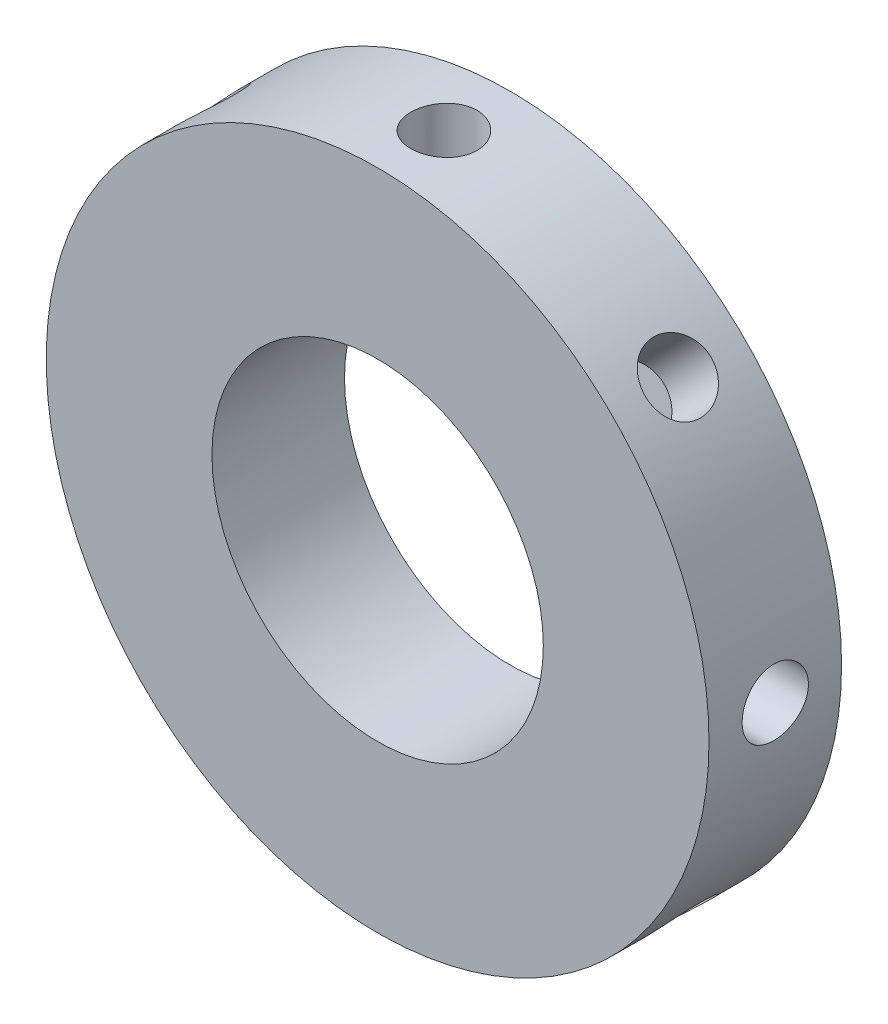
ISO-10303-21;
HEADER;
FILE_DESCRIPTION(('STEP AP214'),'2;1');
FILE_NAME('part.step','',(''),(''),'','','');
FILE_SCHEMA(('AUTOMOTIVE_DESIGN { 1 0 10303 214 1 1 1 1 }'));
ENDSEC;
DATA;
#1=APPLICATION_CONTEXT('core data for automotive mechanical design processes');
#2=APPLICATION_PROTOCOL_DEFINITION('international standard','automotive_design',2000,#1);
#3=PRODUCT_CONTEXT('',#1,'mechanical');
#4=PRODUCT('Part','Part','',(#3));
#5=PRODUCT_RELATED_PRODUCT_CATEGORY('part','',(#4));
#6=PRODUCT_DEFINITION_FORMATION('','',#4);
#7=PRODUCT_DEFINITION_CONTEXT('part definition',#1,'design');
#8=PRODUCT_DEFINITION('design','',#6,#7);
#9=PRODUCT_DEFINITION_SHAPE('','',#8);
#10=(LENGTH_UNIT() NAMED_UNIT(*) SI_UNIT(.MILLI.,.METRE.));
#11=(NAMED_UNIT(*) PLANE_ANGLE_UNIT() SI_UNIT($,.RADIAN.));
#12=(NAMED_UNIT(*) SI_UNIT($,.STERADIAN.) SOLID_ANGLE_UNIT());
#13=UNCERTAINTY_MEASURE_WITH_UNIT(LENGTH_MEASURE(1.E-05),#10,'distance_accuracy_value','');
#14=(GEOMETRIC_REPRESENTATION_CONTEXT(3) GLOBAL_UNCERTAINTY_ASSIGNED_CONTEXT((#13)) GLOBAL_UNIT_ASSIGNED_CONTEXT((#10,
#11,#12)) REPRESENTATION_CONTEXT('',''));
#15=CARTESIAN_POINT('',(0.,0.,0.));
#16=DIRECTION('',(0.,0.,1.));
#17=DIRECTION('',(1.,0.,0.));
#18=AXIS2_PLACEMENT_3D('',#15,#16,#17);
#19=CARTESIAN_POINT('',(0.,0.,40.));
#20=DIRECTION('',(0.,0.,1.));
#21=DIRECTION('',(1.,0.,0.));
#22=AXIS2_PLACEMENT_3D('',#19,#20,#21);
#23=PLANE('',#22);
#24=CARTESIAN_POINT('',(0.,0.,40.));
#25=DIRECTION('',(0.,0.,1.));
#26=DIRECTION('',(1.,0.,0.));
#27=AXIS2_PLACEMENT_3D('',#24,#25,#26);
#28=CIRCLE('',#27,100.);
#29=CARTESIAN_POINT('',(100.,0.,40.));
#30=VERTEX_POINT('',#29);
#31=EDGE_CURVE('E181',#30,#30,#28,.T.);
#32=ORIENTED_EDGE('',*,*,#31,.T.);
#33=EDGE_LOOP('',(#32));
#34=FACE_BOUND('',#33,.T.);
#35=CARTESIAN_POINT('',(0.,0.,40.));
#36=DIRECTION('',(0.,0.,1.));
#37=DIRECTION('',(1.,0.,0.));
#38=AXIS2_PLACEMENT_3D('',#35,#36,#37);
#39=CIRCLE('',#38,50.);
#40=CARTESIAN_POINT('',(50.,0.,40.));
#41=VERTEX_POINT('',#40);
#42=EDGE_CURVE('E214',#41,#41,#39,.T.);
#43=ORIENTED_EDGE('',*,*,#42,.F.);
#44=EDGE_LOOP('',(#43));
#45=FACE_BOUND('',#44,.T.);
#46=ADVANCED_FACE('F43',(#34,#45),#23,.T.);
#47=CARTESIAN_POINT('',(0.,0.,0.));
#48=DIRECTION('',(0.,0.,1.));
#49=DIRECTION('',(1.,0.,0.));
#50=AXIS2_PLACEMENT_3D('',#47,#48,#49);
#51=PLANE('',#50);
#52=CARTESIAN_POINT('',(0.,0.,0.));
#53=DIRECTION('',(0.,0.,1.));
#54=DIRECTION('',(1.,0.,0.));
#55=AXIS2_PLACEMENT_3D('',#52,#53,#54);
#56=CIRCLE('',#55,100.);
#57=CARTESIAN_POINT('',(100.,0.,0.));
#58=VERTEX_POINT('',#57);
#59=EDGE_CURVE('E182',#58,#58,#56,.T.);
#60=ORIENTED_EDGE('',*,*,#59,.F.);
#61=EDGE_LOOP('',(#60));
#62=FACE_BOUND('',#61,.T.);
#63=CARTESIAN_POINT('',(0.,0.,0.));
#64=DIRECTION('',(0.,0.,1.));
#65=DIRECTION('',(1.,0.,0.));
#66=AXIS2_PLACEMENT_3D('',#63,#64,#65);
#67=CIRCLE('',#66,50.);
#68=CARTESIAN_POINT('',(50.,0.,0.));
#69=VERTEX_POINT('',#68);
#70=EDGE_CURVE('E218',#69,#69,#67,.T.);
#71=ORIENTED_EDGE('',*,*,#70,.T.);
#72=EDGE_LOOP('',(#71));
#73=FACE_BOUND('',#72,.T.);
#74=ADVANCED_FACE('F152',(#62,#73),#51,.F.);
#75=CARTESIAN_POINT('',(0.,0.,40.));
#76=DIRECTION('',(0.,0.,-1.));
#77=DIRECTION('',(-1.,0.,0.));
#78=AXIS2_PLACEMENT_3D('',#75,#76,#77);
#79=CYLINDRICAL_SURFACE('',#78,100.);
#80=CARTESIAN_POINT('',(-10.0000000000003,99.4987437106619,20.));
#81=CARTESIAN_POINT('',(-10.0000027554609,99.4987429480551,19.7198030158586));
#82=CARTESIAN_POINT('',(-9.98821900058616,99.4999297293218,19.4396480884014));
#83=CARTESIAN_POINT('',(-9.94117149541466,99.5046415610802,18.8812466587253));
#84=CARTESIAN_POINT('',(-9.90590211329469,99.5081671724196,18.6030006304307));
#85=CARTESIAN_POINT('',(-9.8120874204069,99.5174615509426,18.0502264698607));
#86=CARTESIAN_POINT('',(-9.75351951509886,99.5232324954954,17.7757022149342));
#87=CARTESIAN_POINT('',(-9.61353590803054,99.5368518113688,17.2325882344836));
#88=CARTESIAN_POINT('',(-9.53211976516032,99.5447002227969,16.9639986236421));
#89=CARTESIAN_POINT('',(-9.34708953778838,99.5622445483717,16.4348305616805));
#90=CARTESIAN_POINT('',(-9.24348942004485,99.5719392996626,16.1742471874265));
#91=CARTESIAN_POINT('',(-9.0148053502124,99.5929036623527,15.6627464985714));
#92=CARTESIAN_POINT('',(-8.88972109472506,99.6041732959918,15.4118293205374));
#93=CARTESIAN_POINT('',(-8.61899165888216,99.6279651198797,14.921476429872));
#94=CARTESIAN_POINT('',(-8.47335083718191,99.6404870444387,14.6820382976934));
#95=CARTESIAN_POINT('',(-8.1625194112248,99.6664316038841,14.2162581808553));
#96=CARTESIAN_POINT('',(-7.99732873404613,99.6798542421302,13.98991624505));
#97=CARTESIAN_POINT('',(-7.64799522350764,99.7072663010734,13.5511978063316));
#98=CARTESIAN_POINT('',(-7.46379282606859,99.7212574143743,13.3388688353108));
#99=CARTESIAN_POINT('',(-7.07817805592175,99.7493697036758,12.930469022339));
#100=CARTESIAN_POINT('',(-6.87676563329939,99.7634908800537,12.7343982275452));
#101=CARTESIAN_POINT('',(-6.45813304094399,99.791465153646,12.3598821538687));
#102=CARTESIAN_POINT('',(-6.24091198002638,99.8053182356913,12.1814378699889));
#103=CARTESIAN_POINT('',(-5.79220060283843,99.8323640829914,11.8434501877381));
#104=CARTESIAN_POINT('',(-5.56071060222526,99.8455568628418,11.6839063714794));
#105=CARTESIAN_POINT('',(-5.08457826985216,99.8709367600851,11.3845306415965));
#106=CARTESIAN_POINT('',(-4.83990916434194,99.8831216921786,11.2447411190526));
#107=CARTESIAN_POINT('',(-4.33959724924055,99.9061089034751,10.9862785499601));
#108=CARTESIAN_POINT('',(-4.08395441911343,99.9169111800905,10.8676055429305));
#109=CARTESIAN_POINT('',(-3.56351434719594,99.9368258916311,10.6522369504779));
#110=CARTESIAN_POINT('',(-3.29871728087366,99.9459383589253,10.5555409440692));
#111=CARTESIAN_POINT('',(-2.7618522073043,99.9622142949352,10.38482901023));
#112=CARTESIAN_POINT('',(-2.48978422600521,99.9693777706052,10.3108130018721));
#113=CARTESIAN_POINT('',(-1.94125008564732,99.9815310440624,10.1862145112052));
#114=CARTESIAN_POINT('',(-1.66480180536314,99.9865280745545,10.1355540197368));
#115=CARTESIAN_POINT('',(-1.1085914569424,99.9942417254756,10.057672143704));
#116=CARTESIAN_POINT('',(-0.828829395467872,99.9969583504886,10.0304507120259));
#117=CARTESIAN_POINT('',(-0.26800039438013,100.000034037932,9.99964782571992));
#118=CARTESIAN_POINT('',(0.0130665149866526,100.000393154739,9.99606582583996));
#119=CARTESIAN_POINT('',(0.574497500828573,99.9987437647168,10.0125668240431));
#120=CARTESIAN_POINT('',(0.854861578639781,99.9967352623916,10.0326497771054));
#121=CARTESIAN_POINT('',(1.41187962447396,99.9904190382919,10.096218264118));
#122=CARTESIAN_POINT('',(1.68854328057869,99.9861195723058,10.1396197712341));
#123=CARTESIAN_POINT('',(2.2372162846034,99.9753477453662,10.2494544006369));
#124=CARTESIAN_POINT('',(2.5092256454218,99.9688753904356,10.3158874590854));
#125=CARTESIAN_POINT('',(3.04666993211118,99.9539397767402,10.4713036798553));
#126=CARTESIAN_POINT('',(3.31210479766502,99.9454764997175,10.5602870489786));
#127=CARTESIAN_POINT('',(3.83452965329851,99.9267967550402,10.7601622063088));
#128=CARTESIAN_POINT('',(4.09151962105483,99.9165802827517,10.8710540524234));
#129=CARTESIAN_POINT('',(4.595695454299,99.8946613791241,11.1141660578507));
#130=CARTESIAN_POINT('',(4.84286333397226,99.8829563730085,11.2464232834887));
#131=CARTESIAN_POINT('',(5.32518611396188,99.8584033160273,11.5311851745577));
#132=CARTESIAN_POINT('',(5.56034100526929,99.8455552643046,11.6836898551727));
#133=CARTESIAN_POINT('',(6.01700210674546,99.8190763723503,12.0078728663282));
#134=CARTESIAN_POINT('',(6.23850797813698,99.8054455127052,12.1795516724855));
#135=CARTESIAN_POINT('',(6.666321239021,99.7777836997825,12.5408742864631));
#136=CARTESIAN_POINT('',(6.872628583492,99.7637527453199,12.7305181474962));
#137=CARTESIAN_POINT('',(7.26947402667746,99.7356230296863,13.1273131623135));
#138=CARTESIAN_POINT('',(7.45993908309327,99.7215242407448,13.3345373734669));
#139=CARTESIAN_POINT('',(7.82274279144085,99.6937199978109,13.7643140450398));
#140=CARTESIAN_POINT('',(7.99508138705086,99.6800145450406,13.986866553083));
#141=CARTESIAN_POINT('',(8.32041149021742,99.6533863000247,14.4457356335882));
#142=CARTESIAN_POINT('',(8.47340293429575,99.640463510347,14.6820522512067));
#143=CARTESIAN_POINT('',(8.75894701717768,99.6157688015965,15.1667845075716));
#144=CARTESIAN_POINT('',(8.89149968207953,99.6039968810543,15.4152001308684));
#145=CARTESIAN_POINT('',(9.13524048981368,99.5819379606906,15.9224307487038));
#146=CARTESIAN_POINT('',(9.24642401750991,99.5716512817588,16.1812479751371));
#147=CARTESIAN_POINT('',(9.44658537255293,99.5528610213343,16.7073949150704));
#148=CARTESIAN_POINT('',(9.53556318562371,99.5443574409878,16.9747246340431));
#149=CARTESIAN_POINT('',(9.69066116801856,99.5293783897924,17.5159834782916));
#150=CARTESIAN_POINT('',(9.75678190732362,99.5229028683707,17.7899124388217));
#151=CARTESIAN_POINT('',(9.8656822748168,99.5121666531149,18.3424139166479));
#152=CARTESIAN_POINT('',(9.9084619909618,99.5079059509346,18.6209864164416));
#153=CARTESIAN_POINT('',(9.97023043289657,99.5017359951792,19.1795616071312));
#154=CARTESIAN_POINT('',(9.98932127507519,99.4998166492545,19.4595528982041));
#155=CARTESIAN_POINT('',(10.0039099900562,99.4983509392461,20.0201552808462));
#156=CARTESIAN_POINT('',(9.99940793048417,99.4988045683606,20.3007663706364));
#157=CARTESIAN_POINT('',(9.96684427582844,99.5020717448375,20.8606004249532));
#158=CARTESIAN_POINT('',(9.93878298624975,99.5048852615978,21.1398234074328));
#159=CARTESIAN_POINT('',(9.85930742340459,99.5127913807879,21.6948928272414));
#160=CARTESIAN_POINT('',(9.80789315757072,99.5178839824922,21.9707392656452));
#161=CARTESIAN_POINT('',(9.68222075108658,99.5301892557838,22.5165160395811));
#162=CARTESIAN_POINT('',(9.60801100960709,99.5373974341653,22.7864576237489));
#163=CARTESIAN_POINT('',(9.4372493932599,99.5537325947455,23.3191182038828));
#164=CARTESIAN_POINT('',(9.34069756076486,99.5628595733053,23.5818372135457));
#165=CARTESIAN_POINT('',(9.12594391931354,99.5827734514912,24.0982117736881));
#166=CARTESIAN_POINT('',(9.00774172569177,99.5935603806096,24.351867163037));
#167=CARTESIAN_POINT('',(8.75053126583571,99.616488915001,24.8483361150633));
#168=CARTESIAN_POINT('',(8.61152292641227,99.6286305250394,25.0911496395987));
#169=CARTESIAN_POINT('',(8.31317598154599,99.6539692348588,25.5650489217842));
#170=CARTESIAN_POINT('',(8.15376974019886,99.6671697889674,25.7960919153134));
#171=CARTESIAN_POINT('',(7.81612653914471,99.6942166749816,26.2439418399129));
#172=CARTESIAN_POINT('',(7.63788954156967,99.7080630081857,26.4607487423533));
#173=CARTESIAN_POINT('',(7.26383387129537,99.7360109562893,26.8786155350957));
#174=CARTESIAN_POINT('',(7.06801480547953,99.750112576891,27.0796750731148));
#175=CARTESIAN_POINT('',(6.66017001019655,99.778173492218,27.4646345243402));
#176=CARTESIAN_POINT('',(6.44814426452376,99.7921327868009,27.6485344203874));
#177=CARTESIAN_POINT('',(6.0085756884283,99.8195655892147,27.9985141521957));
#178=CARTESIAN_POINT('',(5.78097961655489,99.8330371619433,28.1645272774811));
#179=CARTESIAN_POINT('',(5.31255918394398,99.8590593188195,28.4767886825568));
#180=CARTESIAN_POINT('',(5.0717347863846,99.8716099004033,28.6230369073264));
#181=CARTESIAN_POINT('',(4.57856059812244,99.8954339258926,28.8947197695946));
#182=CARTESIAN_POINT('',(4.32621092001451,99.9067073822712,29.0201546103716));
#183=CARTESIAN_POINT('',(3.81177248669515,99.927657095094,29.2493069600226));
#184=CARTESIAN_POINT('',(3.54968375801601,99.9373333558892,29.3530245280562));
#185=CARTESIAN_POINT('',(3.01810815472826,99.9547978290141,29.5378227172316));
#186=CARTESIAN_POINT('',(2.7486353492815,99.9625893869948,29.6189434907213));
#187=CARTESIAN_POINT('',(2.20376324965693,99.9760855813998,29.7582015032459));
#188=CARTESIAN_POINT('',(1.92836396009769,99.9817902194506,29.8163387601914));
#189=CARTESIAN_POINT('',(1.37361548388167,99.9909502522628,29.9092013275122));
#190=CARTESIAN_POINT('',(1.09426639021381,99.9944056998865,29.9439271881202));
#191=CARTESIAN_POINT('',(0.533616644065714,99.9989691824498,29.9897126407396));
#192=CARTESIAN_POINT('',(0.252315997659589,100.000077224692,30.0007723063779));
#193=CARTESIAN_POINT('',(-0.308986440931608,99.9999147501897,29.9991474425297));
#194=CARTESIAN_POINT('',(-0.588988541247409,99.9986545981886,29.9865663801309));
#195=CARTESIAN_POINT('',(-1.1469288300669,99.9938117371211,29.9379559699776));
#196=CARTESIAN_POINT('',(-1.42486702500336,99.9902290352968,29.9019266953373));
#197=CARTESIAN_POINT('',(-1.97670320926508,99.9808421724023,29.8066836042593));
#198=CARTESIAN_POINT('',(-2.25060120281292,99.975038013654,29.7474698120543));
#199=CARTESIAN_POINT('',(-2.79241611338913,99.9613718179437,29.6062889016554));
#200=CARTESIAN_POINT('',(-3.06033302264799,99.9535097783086,29.5243217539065));
#201=CARTESIAN_POINT('',(-3.58825661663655,99.9359503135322,29.338240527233));
#202=CARTESIAN_POINT('',(-3.84826441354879,99.9262531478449,29.2341295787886));
#203=CARTESIAN_POINT('',(-4.35858257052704,99.9052950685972,29.004501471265));
#204=CARTESIAN_POINT('',(-4.60889293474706,99.8940341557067,28.8789843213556));
#205=CARTESIAN_POINT('',(-5.09806292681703,99.8702644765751,28.6074392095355));
#206=CARTESIAN_POINT('',(-5.33692267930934,99.8577557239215,28.4614114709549));
#207=CARTESIAN_POINT('',(-5.80152995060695,99.8318405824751,28.1498760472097));
#208=CARTESIAN_POINT('',(-6.02727743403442,99.8184341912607,27.9843683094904));
#209=CARTESIAN_POINT('',(-6.46500452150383,99.7910417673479,27.6343029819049));
#210=CARTESIAN_POINT('',(-6.67692255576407,99.7770535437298,27.4496685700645));
#211=CARTESIAN_POINT('',(-7.08447130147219,99.7489448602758,27.063223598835));
#212=CARTESIAN_POINT('',(-7.28010162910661,99.7348243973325,26.8614126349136));
#213=CARTESIAN_POINT('',(-7.65373978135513,99.7068472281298,26.4419847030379));
#214=CARTESIAN_POINT('',(-7.83174342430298,99.6929905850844,26.2243640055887));
#215=CARTESIAN_POINT('',(-8.16881695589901,99.6659371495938,25.7748887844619));
#216=CARTESIAN_POINT('',(-8.32788711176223,99.6527403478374,25.5430344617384));
#217=CARTESIAN_POINT('',(-8.62635086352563,99.6273485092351,25.0661038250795));
#218=CARTESIAN_POINT('',(-8.76569287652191,99.6151561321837,24.8209950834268));
#219=CARTESIAN_POINT('',(-9.02320974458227,99.5921603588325,24.3198442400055));
#220=CARTESIAN_POINT('',(-9.14138501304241,99.5813569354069,24.0638023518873));
#221=CARTESIAN_POINT('',(-9.35560970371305,99.5614591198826,23.5428517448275));
#222=CARTESIAN_POINT('',(-9.45168106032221,99.5523630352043,23.2779521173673));
#223=CARTESIAN_POINT('',(-9.6211244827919,99.5361300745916,22.7410252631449));
#224=CARTESIAN_POINT('',(-9.69450212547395,99.5289927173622,22.4689998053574));
#225=CARTESIAN_POINT('',(-9.83716407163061,99.5150085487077,21.8346683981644));
#226=CARTESIAN_POINT('',(-9.8981688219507,99.5089338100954,21.4704524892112));
#227=CARTESIAN_POINT('',(-9.9795848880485,99.5008019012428,20.7374667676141));
#228=CARTESIAN_POINT('',(-9.99999637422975,99.4987447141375,20.3686969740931));
#229=CARTESIAN_POINT('',(-10.0000000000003,99.4987437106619,20.));
#230=B_SPLINE_CURVE_WITH_KNOTS('',3,(#80,#81,#82,#83,#84,#85,#86,#87,#88,#89,#90,#91,#92,#93,
#94,#95,#96,#97,#98,#99,#100,#101,#102,#103,#104,#105,#106,#107,#108,#109,#110,#111,#112,#113,
#114,#115,#116,#117,#118,#119,#120,#121,#122,#123,#124,#125,#126,#127,#128,#129,#130,#131,#132,
#133,#134,#135,#136,#137,#138,#139,#140,#141,#142,#143,#144,#145,#146,#147,#148,#149,#150,#151,
#152,#153,#154,#155,#156,#157,#158,#159,#160,#161,#162,#163,#164,#165,#166,#167,#168,#169,#170,
#171,#172,#173,#174,#175,#176,#177,#178,#179,#180,#181,#182,#183,#184,#185,#186,#187,#188,#189,
#190,#191,#192,#193,#194,#195,#196,#197,#198,#199,#200,#201,#202,#203,#204,#205,#206,#207,#208,
#209,#210,#211,#212,#213,#214,#215,#216,#217,#218,#219,#220,#221,#222,#223,#224,#225,#226,#227,
#228,#229),.UNSPECIFIED.,.T.,.F.,(4,2,2,2,2,2,2,2,2,2,2,2,2,2,2,2,2,2,2,2,2,2,2,2,2,2,2,2,2,2,2,
2,2,2,2,2,2,2,2,2,2,2,2,2,2,2,2,2,2,2,2,2,2,2,2,2,2,2,2,2,2,2,2,2,2,2,2,2,2,2,2,2,2,2,4),(0.,
0.840268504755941,1.68073857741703,2.52202571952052,3.36332910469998,4.20410436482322,
5.04489149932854,5.88550062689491,6.72611289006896,7.56944371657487,8.4127769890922,
9.25615783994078,10.099520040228,10.9446654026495,11.7898123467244,12.6349431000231,
13.4800708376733,14.3223549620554,15.1646373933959,16.0069003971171,16.8491617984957,
17.6884083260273,18.5276525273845,19.3669044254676,20.2061585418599,21.046884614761,
21.8876113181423,22.7283588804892,23.5691089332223,24.4135421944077,25.2579780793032,
26.1024167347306,26.9468543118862,27.7914740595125,28.6360943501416,29.4806935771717,
30.3252896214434,31.1662320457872,32.0071720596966,32.8481011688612,33.6890300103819,
34.5281855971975,35.3673395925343,36.2065084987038,37.0456803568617,37.8877105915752,
38.7297425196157,39.5717932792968,40.4138448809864,41.2589355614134,42.1040285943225,
42.949113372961,43.7941958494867,44.637766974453,45.4813374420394,46.3248880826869,
47.168436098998,48.0083008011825,48.8481628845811,49.6880240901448,50.5278863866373,
51.3676300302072,52.2073733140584,53.0471074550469,53.8868438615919,54.7300944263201,
55.5733648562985,56.416834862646,57.2602929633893,58.1059172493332,58.9515250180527,
59.7962900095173,60.6408472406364,61.7465185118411,62.8521851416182),.UNSPECIFIED.);
#231=CARTESIAN_POINT('',(-10.0000000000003,99.4987437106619,20.));
#232=VERTEX_POINT('',#231);
#233=EDGE_CURVE('E10',#232,#232,#230,.T.);
#234=ORIENTED_EDGE('',*,*,#233,.T.);
#235=EDGE_LOOP('',(#234));
#236=FACE_BOUND('',#235,.T.);
#237=CARTESIAN_POINT('',(-77.4273042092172,63.2851685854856,20.));
#238=CARTESIAN_POINT('',(-77.4273056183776,63.2851660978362,19.7198030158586));
#239=CARTESIAN_POINT('',(-77.4198124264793,63.2943376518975,19.4396480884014));
#240=CARTESIAN_POINT('',(-77.3898765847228,63.3309370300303,18.8812466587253));
#241=CARTESIAN_POINT('',(-77.3674303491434,63.3583692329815,18.6030006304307));
#242=CARTESIAN_POINT('',(-77.3076654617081,63.431278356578,18.0502264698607));
#243=CARTESIAN_POINT('',(-77.270332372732,63.4767727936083,17.7757022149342));
#244=CARTESIAN_POINT('',(-77.1809793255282,63.5853864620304,17.2325882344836));
#245=CARTESIAN_POINT('',(-77.128959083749,63.6485060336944,16.9639986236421));
#246=CARTESIAN_POINT('',(-77.0105286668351,63.7917478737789,16.4348305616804));
#247=CARTESIAN_POINT('',(-76.9441275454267,63.8718594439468,16.1742471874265));
#248=CARTESIAN_POINT('',(-76.7972475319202,64.048387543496,15.6627464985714));
#249=CARTESIAN_POINT('',(-76.7167684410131,64.1448043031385,15.4118293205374));
#250=CARTESIAN_POINT('',(-76.5421571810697,64.3530622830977,14.921476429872));
#251=CARTESIAN_POINT('',(-76.4480279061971,64.4649002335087,14.6820382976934));
#252=CARTESIAN_POINT('',(-76.2465824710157,64.7030368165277,14.2162581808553));
#253=CARTESIAN_POINT('',(-76.1392662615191,64.8293355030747,13.98991624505));
#254=CARTESIAN_POINT('',(-75.9116334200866,65.0957348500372,13.5511978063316));
#255=CARTESIAN_POINT('',(-75.791275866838,65.2358788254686,13.3388688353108));
#256=CARTESIAN_POINT('',(-75.5384834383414,65.5284280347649,12.930469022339));
#257=CARTESIAN_POINT('',(-75.406048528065,65.6808333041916,12.7343982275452));
#258=CARTESIAN_POINT('',(-75.1298113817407,65.9966320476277,12.3598821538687));
#259=CARTESIAN_POINT('',(-74.9860085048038,66.1600261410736,12.1814378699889));
#260=CARTESIAN_POINT('',(-74.6878459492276,66.4964373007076,11.8434501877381));
#261=CARTESIAN_POINT('',(-74.533486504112,66.6694541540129,11.6839063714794));
#262=CARTESIAN_POINT('',(-74.2147564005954,67.0240768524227,11.3845306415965));
#263=CARTESIAN_POINT('',(-74.0503652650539,67.2057000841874,11.2447411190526));
#264=CARTESIAN_POINT('',(-73.7128457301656,67.5757284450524,10.9862785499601));
#265=CARTESIAN_POINT('',(-73.5397173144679,67.764133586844,10.8676055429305));
#266=CARTESIAN_POINT('',(-73.1857924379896,68.1462221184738,10.6522369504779));
#267=CARTESIAN_POINT('',(-73.0049961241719,68.3399054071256,10.5555409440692));
#268=CARTESIAN_POINT('',(-72.6368840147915,68.7310351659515,10.38482901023));
#269=CARTESIAN_POINT('',(-72.4495682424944,68.9284816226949,10.3108130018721));
#270=CARTESIAN_POINT('',(-72.0702896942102,69.3249474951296,10.1862145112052));
#271=CARTESIAN_POINT('',(-71.8783446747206,69.5239593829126,10.1355540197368));
#272=CARTESIAN_POINT('',(-71.4904989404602,69.9227138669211,10.057672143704));
#273=CARTESIAN_POINT('',(-71.2945982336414,70.122456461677,10.0304507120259));
#274=CARTESIAN_POINT('',(-70.9002070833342,70.5211972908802,9.99964782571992));
#275=CARTESIAN_POINT('',(-70.7017166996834,70.7201955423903,9.99606582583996));
#276=CARTESIAN_POINT('',(-70.3035587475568,71.1160209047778,10.0125668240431));
#277=CARTESIAN_POINT('',(-70.1038911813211,71.3128480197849,10.0326497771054));
#278=CARTESIAN_POINT('',(-69.7055536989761,71.7022530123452,10.096218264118));
#279=CARTESIAN_POINT('',(-69.5068827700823,71.8948435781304,10.1396197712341));
#280=CARTESIAN_POINT('',(-69.1112955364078,72.2751971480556,10.2494544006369));
#281=CARTESIAN_POINT('',(-68.9143792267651,72.4629601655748,10.3158874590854));
#282=CARTESIAN_POINT('',(-68.523787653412,72.8324295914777,10.4713036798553));
#283=CARTESIAN_POINT('',(-68.3301124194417,73.0141359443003,10.5602870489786));
#284=CARTESIAN_POINT('',(-67.9474936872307,73.370337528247,10.7601622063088));
#285=CARTESIAN_POINT('',(-67.7585502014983,73.5448327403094,10.8710540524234));
#286=CARTESIAN_POINT('',(-67.3865450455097,73.8858398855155,11.1141660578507));
#287=CARTESIAN_POINT('',(-67.2034942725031,74.0523372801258,11.2464232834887));
#288=CARTESIAN_POINT('',(-66.8450789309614,74.3760293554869,11.5311851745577));
#289=CARTESIAN_POINT('',(-66.6697143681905,74.5332240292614,11.6836898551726));
#290=CARTESIAN_POINT('',(-66.3280828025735,74.8374087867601,12.0078728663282));
#291=CARTESIAN_POINT('',(-66.1618160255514,74.9843986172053,12.1795516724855));
#292=CARTESIAN_POINT('',(-65.8397465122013,75.2673484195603,12.5408742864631));
#293=CARTESIAN_POINT('',(-65.6839438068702,75.4033083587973,12.7305181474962));
#294=CARTESIAN_POINT('',(-65.3834409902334,75.6640297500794,13.1273131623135));
#295=CARTESIAN_POINT('',(-65.2387925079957,75.7887395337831,13.3345373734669));
#296=CARTESIAN_POINT('',(-64.9625909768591,76.0256199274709,13.7643140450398));
#297=CARTESIAN_POINT('',(-64.83103796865,76.1377904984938,13.986866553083));
#298=CARTESIAN_POINT('',(-64.582165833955,76.3490046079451,14.4457356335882));
#299=CARTESIAN_POINT('',(-64.4648467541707,76.4480481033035,14.6820522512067));
#300=CARTESIAN_POINT('',(-64.2454748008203,76.6324964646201,15.1667845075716));
#301=CARTESIAN_POINT('',(-64.1434219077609,76.7179013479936,15.4152001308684));
#302=CARTESIAN_POINT('',(-63.9554731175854,76.8746541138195,15.9224307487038));
#303=CARTESIAN_POINT('',(-63.8695807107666,76.9459989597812,16.1812479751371));
#304=CARTESIAN_POINT('',(-63.7147585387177,77.0742476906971,16.7073949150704));
#305=CARTESIAN_POINT('',(-63.6458287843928,77.1311515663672,16.9747246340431));
#306=CARTESIAN_POINT('',(-63.5255661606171,77.230230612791,17.5159834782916));
#307=CARTESIAN_POINT('',(-63.4742328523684,77.2724061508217,17.7899124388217));
#308=CARTESIAN_POINT('',(-63.3896370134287,77.3418186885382,18.3424139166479));
#309=CARTESIAN_POINT('',(-63.356374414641,77.3690557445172,18.6209864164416));
#310=CARTESIAN_POINT('',(-63.3083347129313,77.4083698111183,19.1795616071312));
#311=CARTESIAN_POINT('',(-63.2934782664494,77.4205118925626,19.4595528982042));
#312=CARTESIAN_POINT('',(-63.2821260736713,77.4297912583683,20.0201552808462));
#313=CARTESIAN_POINT('',(-63.2856302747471,77.4269285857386,20.3007663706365));
#314=CARTESIAN_POINT('',(-63.3109664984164,77.4062128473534,20.8606004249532));
#315=CARTESIAN_POINT('',(-63.3327982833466,77.3883599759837,21.1398234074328));
#316=CARTESIAN_POINT('',(-63.3945864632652,77.3377527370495,21.6948928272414));
#317=CARTESIAN_POINT('',(-63.4345428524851,77.3049983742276,21.9707392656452));
#318=CARTESIAN_POINT('',(-63.5321078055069,77.2248357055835,22.5165160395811));
#319=CARTESIAN_POINT('',(-63.5896789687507,77.1774584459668,22.7864576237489));
#320=CARTESIAN_POINT('',(-63.7219763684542,77.0682624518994,23.3191182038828));
#321=CARTESIAN_POINT('',(-63.7967025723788,77.0064437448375,23.5818372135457));
#322=CARTESIAN_POINT('',(-63.9626375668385,76.8686712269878,24.0982117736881));
#323=CARTESIAN_POINT('',(-64.0538466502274,76.7927171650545,24.351867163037));
#324=CARTESIAN_POINT('',(-64.2519348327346,76.627054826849,24.8483361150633));
#325=CARTESIAN_POINT('',(-64.358813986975,76.5373465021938,25.0911496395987));
#326=CARTESIAN_POINT('',(-64.5876943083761,76.3443005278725,25.5650489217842));
#327=CARTESIAN_POINT('',(-64.7097457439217,76.240917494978,25.7960919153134));
#328=CARTESIAN_POINT('',(-64.9676205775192,76.0212927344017,26.2439418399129));
#329=CARTESIAN_POINT('',(-65.1034440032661,75.9050509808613,26.4607487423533));
#330=CARTESIAN_POINT('',(-65.3877034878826,75.6603158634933,26.8786155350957));
#331=CARTESIAN_POINT('',(-65.5361398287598,75.5318222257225,27.0796750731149));
#332=CARTESIAN_POINT('',(-65.84437171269,75.2632744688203,27.4646345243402));
#333=CARTESIAN_POINT('',(-66.0041672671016,75.1232203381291,27.6485344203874));
#334=CARTESIAN_POINT('',(-66.3343871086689,74.8317963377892,27.9985141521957));
#335=CARTESIAN_POINT('',(-66.5048476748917,74.6803874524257,28.1645272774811));
#336=CARTESIAN_POINT('',(-66.8544713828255,74.3675646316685,28.4767886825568));
#337=CARTESIAN_POINT('',(-67.0336345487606,74.2061506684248,28.6230369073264));
#338=CARTESIAN_POINT('',(-67.3992074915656,73.8742699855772,28.8947197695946));
#339=CARTESIAN_POINT('',(-67.5856171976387,73.7038033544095,29.0201546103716));
#340=CARTESIAN_POINT('',(-67.9641937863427,73.3548541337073,29.2493069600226));
#341=CARTESIAN_POINT('',(-68.156360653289,73.1763715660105,29.3530245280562));
#342=CARTESIAN_POINT('',(-68.5445906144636,72.8128400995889,29.5378227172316));
#343=CARTESIAN_POINT('',(-68.7406461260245,72.6278035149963,29.6189434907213));
#344=CARTESIAN_POINT('',(-69.1354721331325,72.2520640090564,29.7582015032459));
#345=CARTESIAN_POINT('',(-69.3342426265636,72.061361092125,29.8163387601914));
#346=CARTESIAN_POINT('',(-69.7329861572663,71.6755718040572,29.9092013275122));
#347=CARTESIAN_POINT('',(-69.9329591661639,71.4804855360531,29.9439271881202));
#348=CARTESIAN_POINT('',(-70.3326252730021,71.0872731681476,29.9897126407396));
#349=CARTESIAN_POINT('',(-70.5323183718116,70.8891470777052,30.0007723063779));
#350=CARTESIAN_POINT('',(-70.9291042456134,70.4921314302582,29.9991474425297));
#351=CARTESIAN_POINT('',(-71.1262045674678,70.2932489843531,29.9865663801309));
#352=CARTESIAN_POINT('',(-71.5173035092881,69.8953012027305,29.9379559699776));
#353=CARTESIAN_POINT('',(-71.7113021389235,69.6962358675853,29.9019266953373));
#354=CARTESIAN_POINT('',(-72.0948717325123,69.2993912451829,29.8066836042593));
#355=CARTESIAN_POINT('',(-72.2844427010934,69.1016119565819,29.7474698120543));
#356=CARTESIAN_POINT('',(-72.65790023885,68.7088274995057,29.6062889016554));
#357=CARTESIAN_POINT('',(-72.8417868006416,68.5138223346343,29.5243217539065));
#358=CARTESIAN_POINT('',(-73.2026687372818,68.1281075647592,29.338240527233));
#359=CARTESIAN_POINT('',(-73.379665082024,67.9373973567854,29.2341295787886));
#360=CARTESIAN_POINT('',(-73.7256949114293,67.5617283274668,29.004501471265));
#361=CARTESIAN_POINT('',(-73.8947283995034,67.3767695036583,28.8789843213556));
#362=CARTESIAN_POINT('',(-74.2238161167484,67.014066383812,28.6074392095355));
#363=CARTESIAN_POINT('',(-74.3838704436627,66.8363220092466,28.4614114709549));
#364=CARTESIAN_POINT('',(-74.6940726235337,66.4894702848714,28.1498760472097));
#365=CARTESIAN_POINT('',(-74.8442204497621,66.320362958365,27.9843683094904));
#366=CARTESIAN_POINT('',(-75.1343708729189,65.9914737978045,27.6343029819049));
#367=CARTESIAN_POINT('',(-75.2743283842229,65.8317339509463,27.4496685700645));
#368=CARTESIAN_POINT('',(-75.5426330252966,65.5236776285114,27.063223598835));
#369=CARTESIAN_POINT('',(-75.670979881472,65.3753614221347,26.8614126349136));
#370=CARTESIAN_POINT('',(-75.9153991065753,65.0913765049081,26.4419847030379));
#371=CARTESIAN_POINT('',(-76.0314685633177,64.9557107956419,26.2243640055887));
#372=CARTESIAN_POINT('',(-76.2506858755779,64.698234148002,25.7748887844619));
#373=CARTESIAN_POINT('',(-76.3538339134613,64.5764230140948,25.5430344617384));
#374=CARTESIAN_POINT('',(-76.5469249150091,64.3474225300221,25.0661038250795));
#375=CARTESIAN_POINT('',(-76.6368332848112,64.2402715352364,24.8209950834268));
#376=CARTESIAN_POINT('',(-76.8026647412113,64.0419191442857,24.3198442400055));
#377=CARTESIAN_POINT('',(-76.8785881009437,63.9507174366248,24.0638023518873));
#378=CARTESIAN_POINT('',(-77.0159979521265,63.7851678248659,23.5428517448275));
#379=CARTESIAN_POINT('',(-77.0774987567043,63.7108032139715,23.2779521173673));
#380=CARTESIAN_POINT('',(-77.1858349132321,63.5795101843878,22.7410252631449));
#381=CARTESIAN_POINT('',(-77.2326738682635,63.5225774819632,22.4689998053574));
#382=CARTESIAN_POINT('',(-77.3236627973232,63.4118119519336,21.8346683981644));
#383=CARTESIAN_POINT('',(-77.3625041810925,63.364379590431,21.4704524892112));
#384=CARTESIAN_POINT('',(-77.4143239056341,63.3010596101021,20.7374667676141));
#385=CARTESIAN_POINT('',(-77.4273023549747,63.2851718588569,20.3686969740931));
#386=CARTESIAN_POINT('',(-77.4273042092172,63.2851685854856,20.));
#387=B_SPLINE_CURVE_WITH_KNOTS('',3,(#237,#238,#239,#240,#241,#242,#243,#244,#245,#246,#247,
#248,#249,#250,#251,#252,#253,#254,#255,#256,#257,#258,#259,#260,#261,#262,#263,#264,#265,#266,
#267,#268,#269,#270,#271,#272,#273,#274,#275,#276,#277,#278,#279,#280,#281,#282,#283,#284,#285,
#286,#287,#288,#289,#290,#291,#292,#293,#294,#295,#296,#297,#298,#299,#300,#301,#302,#303,#304,
#305,#306,#307,#308,#309,#310,#311,#312,#313,#314,#315,#316,#317,#318,#319,#320,#321,#322,#323,
#324,#325,#326,#327,#328,#329,#330,#331,#332,#333,#334,#335,#336,#337,#338,#339,#340,#341,#342,
#343,#344,#345,#346,#347,#348,#349,#350,#351,#352,#353,#354,#355,#356,#357,#358,#359,#360,#361,
#362,#363,#364,#365,#366,#367,#368,#369,#370,#371,#372,#373,#374,#375,#376,#377,#378,#379,#380,
#381,#382,#383,#384,#385,#386),.UNSPECIFIED.,.T.,.F.,(4,2,2,2,2,2,2,2,2,2,2,2,2,2,2,2,2,2,2,2,2,
2,2,2,2,2,2,2,2,2,2,2,2,2,2,2,2,2,2,2,2,2,2,2,2,2,2,2,2,2,2,2,2,2,2,2,2,2,2,2,2,2,2,2,2,2,2,2,2,
2,2,2,2,2,4),(0.,0.84026850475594,1.68073857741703,2.52202571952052,3.36332910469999,
4.20410436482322,5.04489149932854,5.88550062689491,6.72611289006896,7.56944371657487,
8.41277698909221,9.25615783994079,10.099520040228,10.9446654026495,11.7898123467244,
12.6349431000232,13.4800708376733,14.3223549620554,15.1646373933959,16.0069003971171,
16.8491617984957,17.6884083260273,18.5276525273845,19.3669044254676,20.2061585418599,
21.046884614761,21.8876113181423,22.7283588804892,23.5691089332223,24.4135421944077,
25.2579780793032,26.1024167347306,26.9468543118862,27.7914740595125,28.6360943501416,
29.4806935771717,30.3252896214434,31.1662320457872,32.0071720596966,32.8481011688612,
33.6890300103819,34.5281855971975,35.3673395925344,36.2065084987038,37.0456803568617,
37.8877105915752,38.7297425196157,39.5717932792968,40.4138448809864,41.2589355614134,
42.1040285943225,42.949113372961,43.7941958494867,44.637766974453,45.4813374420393,
46.3248880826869,47.168436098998,48.0083008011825,48.8481628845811,49.6880240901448,
50.5278863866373,51.3676300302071,52.2073733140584,53.0471074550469,53.8868438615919,
54.73009442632,55.5733648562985,56.416834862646,57.2602929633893,58.1059172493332,
58.9515250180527,59.7962900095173,60.6408472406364,61.7465185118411,62.8521851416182),.UNSPECIFIED.);
#388=CARTESIAN_POINT('',(-77.4273042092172,63.2851685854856,20.));
#389=VERTEX_POINT('',#388);
#390=EDGE_CURVE('E56',#389,#389,#387,.T.);
#391=ORIENTED_EDGE('',*,*,#390,.T.);
#392=EDGE_LOOP('',(#391));
#393=FACE_BOUND('',#392,.T.);
#394=CARTESIAN_POINT('',(-100.,0.,30.));
#395=CARTESIAN_POINT('',(-100.000000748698,-0.280200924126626,30.0000027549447));
#396=CARTESIAN_POINT('',(-99.9988199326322,-0.560359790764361,29.9882186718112));
#397=CARTESIAN_POINT('',(-99.9941312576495,-1.11876920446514,29.9411698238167));
#398=CARTESIAN_POINT('',(-99.9906228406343,-1.39701927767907,29.9058994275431));
#399=CARTESIAN_POINT('',(-99.9813721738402,-1.94980162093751,29.8120819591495));
#400=CARTESIAN_POINT('',(-99.9756277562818,-2.22433001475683,29.7535122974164));
#401=CARTESIAN_POINT('',(-99.9620678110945,-2.76745235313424,29.6135243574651));
#402=CARTESIAN_POINT('',(-99.9542522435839,-3.03604618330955,29.5321056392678));
#403=CARTESIAN_POINT('',(-99.9367761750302,-3.56522322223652,29.3470691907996));
#404=CARTESIAN_POINT('',(-99.9271168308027,-3.82581133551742,29.2434653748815));
#405=CARTESIAN_POINT('',(-99.9062219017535,-4.33732109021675,29.0147730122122));
#406=CARTESIAN_POINT('',(-99.8949862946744,-4.58824259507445,28.889684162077));
#407=CARTESIAN_POINT('',(-99.8712573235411,-5.07860335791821,28.6189448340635));
#408=CARTESIAN_POINT('',(-99.8587642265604,-5.3180450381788,28.4732987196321));
#409=CARTESIAN_POINT('',(-99.832868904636,-5.78383126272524,28.1624562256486));
#410=CARTESIAN_POINT('',(-99.819466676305,-6.01017575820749,27.9972597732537));
#411=CARTESIAN_POINT('',(-99.7920852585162,-6.44889060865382,27.6479205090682));
#412=CARTESIAN_POINT('',(-99.778104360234,-6.66121393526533,27.4637187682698));
#413=CARTESIAN_POINT('',(-99.7500006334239,-7.06960241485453,27.0781065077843));
#414=CARTESIAN_POINT('',(-99.7358778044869,-7.26566752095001,26.8766959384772));
#415=CARTESIAN_POINT('',(-99.7078885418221,-7.64017247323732,26.4580681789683));
#416=CARTESIAN_POINT('',(-99.6940221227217,-7.81861131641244,26.2408500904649));
#417=CARTESIAN_POINT('',(-99.6669394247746,-8.15658855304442,25.7921457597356));
#418=CARTESIAN_POINT('',(-99.6537231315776,-8.31612736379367,25.5606598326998));
#419=CARTESIAN_POINT('',(-99.6282883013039,-8.61549746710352,25.0845306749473));
#420=CARTESIAN_POINT('',(-99.6160719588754,-8.75528587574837,24.8398603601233));
#421=CARTESIAN_POINT('',(-99.5930179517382,-9.01374608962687,24.3395461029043));
#422=CARTESIAN_POINT('',(-99.582180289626,-9.13241785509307,24.0839021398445));
#423=CARTESIAN_POINT('',(-99.5621948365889,-9.34778387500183,23.5634597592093));
#424=CARTESIAN_POINT('',(-99.5530470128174,-9.44447855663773,23.2986615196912));
#425=CARTESIAN_POINT('',(-99.5367044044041,-9.61518777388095,22.7617938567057));
#426=CARTESIAN_POINT('',(-99.5295096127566,-9.68920239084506,22.4897244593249));
#427=CARTESIAN_POINT('',(-99.5173013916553,-9.81379812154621,21.9411864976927));
#428=CARTESIAN_POINT('',(-99.512280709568,-9.86445718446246,21.664735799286));
#429=CARTESIAN_POINT('',(-99.5045300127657,-9.94233583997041,21.1085204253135));
#430=CARTESIAN_POINT('',(-99.5017999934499,-9.96955547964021,20.8287557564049));
#431=CARTESIAN_POINT('',(-99.4987093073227,-10.0003543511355,20.2679216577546));
#432=CARTESIAN_POINT('',(-99.498348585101,-10.0039341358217,19.9868522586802));
#433=CARTESIAN_POINT('',(-99.5000067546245,-9.98742830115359,19.4254165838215));
#434=CARTESIAN_POINT('',(-99.5020256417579,-9.96734272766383,19.1450503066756));
#435=CARTESIAN_POINT('',(-99.5083732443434,-9.90377035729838,18.5880430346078));
#436=CARTESIAN_POINT('',(-99.5126935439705,-9.86036881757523,18.3113922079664));
#437=CARTESIAN_POINT('',(-99.5235152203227,-9.7505363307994,17.7627449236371));
#438=CARTESIAN_POINT('',(-99.5300165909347,-9.6841054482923,17.4907484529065));
#439=CARTESIAN_POINT('',(-99.5450151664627,-9.52869578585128,16.9533295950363));
#440=CARTESIAN_POINT('',(-99.5535123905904,-9.43971678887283,16.6879072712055));
#441=CARTESIAN_POINT('',(-99.5722611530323,-9.23985254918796,16.1655068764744));
#442=CARTESIAN_POINT('',(-99.5825126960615,-9.1289672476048,15.9085288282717));
#443=CARTESIAN_POINT('',(-99.6044993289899,-8.88586665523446,15.4043681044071));
#444=CARTESIAN_POINT('',(-99.6162370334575,-8.75361365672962,15.1572037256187));
#445=CARTESIAN_POINT('',(-99.6408491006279,-8.46886076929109,14.6748872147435));
#446=CARTESIAN_POINT('',(-99.6537234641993,-8.31636086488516,14.4397350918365));
#447=CARTESIAN_POINT('',(-99.6802456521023,-7.99218770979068,13.9830785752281));
#448=CARTESIAN_POINT('',(-99.6938934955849,-7.82051398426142,13.7615745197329));
#449=CARTESIAN_POINT('',(-99.7215780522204,-7.45920156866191,13.3337638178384));
#450=CARTESIAN_POINT('',(-99.7356147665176,-7.26956282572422,13.1274572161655));
#451=CARTESIAN_POINT('',(-99.7637445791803,-6.8727715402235,12.7306058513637));
#452=CARTESIAN_POINT('',(-99.77783765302,-6.66554540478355,12.5401346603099));
#453=CARTESIAN_POINT('',(-99.805619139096,-6.23576363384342,12.1773189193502));
#454=CARTESIAN_POINT('',(-99.8193075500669,-6.01320795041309,12.0049744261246));
#455=CARTESIAN_POINT('',(-99.8458923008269,-5.55433148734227,11.6796331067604));
#456=CARTESIAN_POINT('',(-99.8587886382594,-5.31801066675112,11.5266363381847));
#457=CARTESIAN_POINT('',(-99.8834240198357,-4.83326917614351,11.2410823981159));
#458=CARTESIAN_POINT('',(-99.8951630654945,-4.58484852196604,11.1085251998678));
#459=CARTESIAN_POINT('',(-99.9171531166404,-4.07761659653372,10.8647807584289));
#460=CARTESIAN_POINT('',(-99.9274038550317,-3.81880347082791,10.7535973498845));
#461=CARTESIAN_POINT('',(-99.9461236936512,-3.29266510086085,10.5534356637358));
#462=CARTESIAN_POINT('',(-99.9545927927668,-3.02533985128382,10.4644573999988));
#463=CARTESIAN_POINT('',(-99.9695082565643,-2.484090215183,10.3093578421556));
#464=CARTESIAN_POINT('',(-99.9759546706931,-2.21016599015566,10.243235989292));
#465=CARTESIAN_POINT('',(-99.9866413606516,-1.65767428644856,10.1343326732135));
#466=CARTESIAN_POINT('',(-99.9908816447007,-1.37910682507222,10.091551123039));
#467=CARTESIAN_POINT('',(-99.9970219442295,-0.820533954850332,10.0297773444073));
#468=CARTESIAN_POINT('',(-99.998931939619,-0.540539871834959,10.0106836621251));
#469=CARTESIAN_POINT('',(-100.000390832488,0.0200682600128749,9.99608975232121));
#470=CARTESIAN_POINT('',(-99.9999397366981,0.300682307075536,10.0005894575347));
#471=CARTESIAN_POINT('',(-99.9966892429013,0.860522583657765,10.0331489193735));
#472=CARTESIAN_POINT('',(-99.9938898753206,1.13974883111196,10.0612083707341));
#473=CARTESIAN_POINT('',(-99.9860220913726,1.69482517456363,10.1406808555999));
#474=CARTESIAN_POINT('',(-99.980953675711,1.97067527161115,10.1920938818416));
#475=CARTESIAN_POINT('',(-99.9687038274,2.51646910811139,10.3177666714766));
#476=CARTESIAN_POINT('',(-99.9615267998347,2.78642391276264,10.3919788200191));
#477=CARTESIAN_POINT('',(-99.9452575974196,3.31911062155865,10.5627475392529));
#478=CARTESIAN_POINT('',(-99.9361654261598,3.58184253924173,10.6593040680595));
#479=CARTESIAN_POINT('',(-99.9163209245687,4.09824206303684,10.8740692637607));
#480=CARTESIAN_POINT('',(-99.9055685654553,4.3519095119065,10.9922783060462));
#481=CARTESIAN_POINT('',(-99.8827050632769,4.8484013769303,11.2495044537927));
#482=CARTESIAN_POINT('',(-99.8705939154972,5.09122575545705,11.3885216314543));
#483=CARTESIAN_POINT('',(-99.8453093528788,5.56513302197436,11.6868803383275));
#484=CARTESIAN_POINT('',(-99.832132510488,5.79617378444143,11.8462884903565));
#485=CARTESIAN_POINT('',(-99.8051229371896,6.2440187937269,12.1839349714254));
#486=CARTESIAN_POINT('',(-99.7912902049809,6.46082301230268,12.362173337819));
#487=CARTESIAN_POINT('',(-99.7633578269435,6.87868406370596,12.7362310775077));
#488=CARTESIAN_POINT('',(-99.7492581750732,7.07974053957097,12.932050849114));
#489=CARTESIAN_POINT('',(-99.7211893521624,7.46469356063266,13.3398962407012));
#490=CARTESIAN_POINT('',(-99.7072201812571,7.64859008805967,13.5519218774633));
#491=CARTESIAN_POINT('',(-99.6797568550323,7.99856265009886,13.9914890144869));
#492=CARTESIAN_POINT('',(-99.6662645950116,8.16457200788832,14.2190837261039));
#493=CARTESIAN_POINT('',(-99.6401925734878,8.47682609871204,14.6875007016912));
#494=CARTESIAN_POINT('',(-99.6276128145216,8.62307077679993,14.9283230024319));
#495=CARTESIAN_POINT('',(-99.6037252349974,8.89474699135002,15.4214925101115));
#496=CARTESIAN_POINT('',(-99.5924174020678,9.02017873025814,15.6738396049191));
#497=CARTESIAN_POINT('',(-99.571397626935,9.2493254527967,16.1882726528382));
#498=CARTESIAN_POINT('',(-99.5616856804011,9.35304049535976,16.4503585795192));
#499=CARTESIAN_POINT('',(-99.5441523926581,9.53783680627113,16.9819359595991));
#500=CARTESIAN_POINT('',(-99.536327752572,9.61895760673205,17.2514135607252));
#501=CARTESIAN_POINT('',(-99.5227719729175,9.75821495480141,17.7962957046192));
#502=CARTESIAN_POINT('',(-99.517040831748,9.8163515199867,18.0717002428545));
#503=CARTESIAN_POINT('',(-99.5078373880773,9.90921184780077,18.6264593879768));
#504=CARTESIAN_POINT('',(-99.5043650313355,9.94393617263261,18.9058138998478));
#505=CARTESIAN_POINT('',(-99.4997792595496,9.98971765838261,19.4664745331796));
#506=CARTESIAN_POINT('',(-99.4986658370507,10.0007748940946,19.7477806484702));
#507=CARTESIAN_POINT('',(-99.4988297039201,9.99914431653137,20.3090797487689));
#508=CARTESIAN_POINT('',(-99.5000964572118,9.98656114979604,20.5890730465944));
#509=CARTESIAN_POINT('',(-99.5049636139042,9.9379480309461,21.1469954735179));
#510=CARTESIAN_POINT('',(-99.5085640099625,9.90191815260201,21.4249246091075));
#511=CARTESIAN_POINT('',(-99.5179953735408,9.80667541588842,21.9767425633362));
#512=CARTESIAN_POINT('',(-99.5238263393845,9.74746257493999,22.2506313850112));
#513=CARTESIAN_POINT('',(-99.5375522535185,9.60628519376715,22.7924279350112));
#514=CARTESIAN_POINT('',(-99.5454472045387,9.52432062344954,23.0603356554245));
#515=CARTESIAN_POINT('',(-99.5630748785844,9.33824637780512,23.5882405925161));
#516=CARTESIAN_POINT('',(-99.5728073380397,9.23413987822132,23.8482389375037));
#517=CARTESIAN_POINT('',(-99.5938344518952,9.00452230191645,24.3585388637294));
#518=CARTESIAN_POINT('',(-99.6051291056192,8.87901123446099,24.6088404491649));
#519=CARTESIAN_POINT('',(-99.6289609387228,8.60747968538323,25.0979940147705));
#520=CARTESIAN_POINT('',(-99.6414981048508,8.46145942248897,25.3368461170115));
#521=CARTESIAN_POINT('',(-99.6674615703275,8.14994007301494,25.8014395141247));
#522=CARTESIAN_POINT('',(-99.680887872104,7.98444093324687,26.0271807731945));
#523=CARTESIAN_POINT('',(-99.7083101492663,7.63438465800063,26.4649082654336));
#524=CARTESIAN_POINT('',(-99.7223082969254,7.44974976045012,26.6768321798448));
#525=CARTESIAN_POINT('',(-99.7504249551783,7.06330260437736,27.0843927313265));
#526=CARTESIAN_POINT('',(-99.7645434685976,6.86148994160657,27.2800289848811));
#527=CARTESIAN_POINT('',(-99.7925050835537,6.44205744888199,27.6536787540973));
#528=CARTESIAN_POINT('',(-99.8063481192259,6.22443389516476,27.8316880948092));
#529=CARTESIAN_POINT('',(-99.8333642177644,5.77495183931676,28.1687725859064));
#530=CARTESIAN_POINT('',(-99.8465372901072,5.54309353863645,28.3278480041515));
#531=CARTESIAN_POINT('',(-99.8718738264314,5.06616003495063,28.6263178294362));
#532=CARTESIAN_POINT('',(-99.8840346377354,4.82105272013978,28.7656611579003));
#533=CARTESIAN_POINT('',(-99.9069634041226,4.3199046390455,29.0231808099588));
#534=CARTESIAN_POINT('',(-99.91773138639,4.063864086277,29.1413575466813));
#535=CARTESIAN_POINT('',(-99.9375584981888,3.542916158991,29.3555852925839));
#536=CARTESIAN_POINT('',(-99.9466193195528,3.27801787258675,29.4516582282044));
#537=CARTESIAN_POINT('',(-99.962785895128,2.74109391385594,29.6211048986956));
#538=CARTESIAN_POINT('',(-99.9698921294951,2.46907000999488,29.6944842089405));
#539=CARTESIAN_POINT('',(-99.9838136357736,1.83472843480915,29.8371533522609));
#540=CARTESIAN_POINT('',(-99.9898594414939,1.47050053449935,29.8981621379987));
#541=CARTESIAN_POINT('',(-99.9979521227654,0.737490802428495,29.9795835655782));
#542=CARTESIAN_POINT('',(-99.9999990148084,0.368708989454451,29.999996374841));
#543=CARTESIAN_POINT('',(-100.,0.,30.));
#544=B_SPLINE_CURVE_WITH_KNOTS('',3,(#394,#395,#396,#397,#398,#399,#400,#401,#402,#403,#404,
#405,#406,#407,#408,#409,#410,#411,#412,#413,#414,#415,#416,#417,#418,#419,#420,#421,#422,#423,
#424,#425,#426,#427,#428,#429,#430,#431,#432,#433,#434,#435,#436,#437,#438,#439,#440,#441,#442,
#443,#444,#445,#446,#447,#448,#449,#450,#451,#452,#453,#454,#455,#456,#457,#458,#459,#460,#461,
#462,#463,#464,#465,#466,#467,#468,#469,#470,#471,#472,#473,#474,#475,#476,#477,#478,#479,#480,
#481,#482,#483,#484,#485,#486,#487,#488,#489,#490,#491,#492,#493,#494,#495,#496,#497,#498,#499,
#500,#501,#502,#503,#504,#505,#506,#507,#508,#509,#510,#511,#512,#513,#514,#515,#516,#517,#518,
#519,#520,#521,#522,#523,#524,#525,#526,#527,#528,#529,#530,#531,#532,#533,#534,#535,#536,#537,
#538,#539,#540,#541,#542,#543),.UNSPECIFIED.,.T.,.F.,(4,2,2,2,2,2,2,2,2,2,2,2,2,2,2,2,2,2,2,2,2,
2,2,2,2,2,2,2,2,2,2,2,2,2,2,2,2,2,2,2,2,2,2,2,2,2,2,2,2,2,2,2,2,2,2,2,2,2,2,2,2,2,2,2,2,2,2,2,2,
2,2,2,2,2,4),(0.,0.840280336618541,1.68076222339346,2.52206098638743,3.36337595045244,
4.20416478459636,5.04496549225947,5.88558800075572,6.72621364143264,7.56952892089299,
8.41284663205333,9.25621230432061,10.0995593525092,10.9447103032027,11.7898628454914,
12.6349989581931,13.4801320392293,14.3224236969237,15.164713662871,16.0069839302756,
16.8492525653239,17.6884621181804,18.5276693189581,19.3668845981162,20.206102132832,
21.046817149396,21.8875328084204,22.728269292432,23.5690082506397,24.4134572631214,
25.2579089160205,26.1023630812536,26.9468161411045,27.7914205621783,28.6360255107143,
29.480609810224,30.3251909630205,31.1661421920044,32.0070910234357,32.8480289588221,
33.6889666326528,34.5281598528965,35.3673515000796,36.2065576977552,37.0457668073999,
37.8877914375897,38.7298177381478,39.5718631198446,40.4139093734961,41.258993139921,
42.1040792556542,42.9491571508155,43.794232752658,44.63782034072,45.4814072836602,
46.3249739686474,47.1685379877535,48.0083766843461,48.8482127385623,49.6880481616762,
50.5278846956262,51.3676008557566,52.2073166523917,53.0470234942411,53.8867326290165,
54.7299988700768,55.5732849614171,56.416770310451,57.2602437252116,58.1058621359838,
58.9514640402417,59.7962234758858,60.6407752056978,61.7464824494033,62.8521851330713),.UNSPECIFIED.);
#545=CARTESIAN_POINT('',(-100.,0.,30.));
#546=VERTEX_POINT('',#545);
#547=EDGE_CURVE('E61',#546,#546,#544,.T.);
#548=ORIENTED_EDGE('',*,*,#547,.T.);
#549=EDGE_LOOP('',(#548));
#550=FACE_BOUND('',#549,.T.);
#551=CARTESIAN_POINT('',(-63.2851685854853,-77.4273042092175,20.));
#552=CARTESIAN_POINT('',(-63.2851660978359,-77.4273056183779,19.7198030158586));
#553=CARTESIAN_POINT('',(-63.2943376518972,-77.4198124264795,19.4396480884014));
#554=CARTESIAN_POINT('',(-63.3309370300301,-77.389876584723,18.8812466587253));
#555=CARTESIAN_POINT('',(-63.3583692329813,-77.3674303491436,18.6030006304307));
#556=CARTESIAN_POINT('',(-63.4312783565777,-77.3076654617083,18.0502264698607));
#557=CARTESIAN_POINT('',(-63.476772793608,-77.2703323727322,17.7757022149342));
#558=CARTESIAN_POINT('',(-63.5853864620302,-77.1809793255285,17.2325882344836));
#559=CARTESIAN_POINT('',(-63.6485060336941,-77.1289590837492,16.9639986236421));
#560=CARTESIAN_POINT('',(-63.7917478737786,-77.0105286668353,16.4348305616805));
#561=CARTESIAN_POINT('',(-63.8718594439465,-76.9441275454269,16.1742471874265));
#562=CARTESIAN_POINT('',(-64.0483875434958,-76.7972475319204,15.6627464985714));
#563=CARTESIAN_POINT('',(-64.1448043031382,-76.7167684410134,15.4118293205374));
#564=CARTESIAN_POINT('',(-64.3530622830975,-76.54215718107,14.921476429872));
#565=CARTESIAN_POINT('',(-64.4649002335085,-76.4480279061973,14.6820382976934));
#566=CARTESIAN_POINT('',(-64.7030368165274,-76.2465824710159,14.2162581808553));
#567=CARTESIAN_POINT('',(-64.8293355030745,-76.1392662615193,13.98991624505));
#568=CARTESIAN_POINT('',(-65.095734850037,-75.9116334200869,13.5511978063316));
#569=CARTESIAN_POINT('',(-65.2358788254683,-75.7912758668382,13.3388688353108));
#570=CARTESIAN_POINT('',(-65.5284280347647,-75.5384834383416,12.930469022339));
#571=CARTESIAN_POINT('',(-65.6808333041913,-75.4060485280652,12.7343982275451));
#572=CARTESIAN_POINT('',(-65.9966320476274,-75.1298113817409,12.3598821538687));
#573=CARTESIAN_POINT('',(-66.1600261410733,-74.986008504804,12.1814378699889));
#574=CARTESIAN_POINT('',(-66.4964373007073,-74.6878459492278,11.8434501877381));
#575=CARTESIAN_POINT('',(-66.6694541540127,-74.5334865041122,11.6839063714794));
#576=CARTESIAN_POINT('',(-67.0240768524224,-74.2147564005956,11.3845306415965));
#577=CARTESIAN_POINT('',(-67.2057000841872,-74.0503652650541,11.2447411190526));
#578=CARTESIAN_POINT('',(-67.5757284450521,-73.7128457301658,10.9862785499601));
#579=CARTESIAN_POINT('',(-67.7641335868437,-73.5397173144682,10.8676055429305));
#580=CARTESIAN_POINT('',(-68.1462221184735,-73.1857924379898,10.6522369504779));
#581=CARTESIAN_POINT('',(-68.3399054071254,-73.0049961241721,10.5555409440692));
#582=CARTESIAN_POINT('',(-68.7310351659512,-72.6368840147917,10.38482901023));
#583=CARTESIAN_POINT('',(-68.9284816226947,-72.4495682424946,10.3108130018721));
#584=CARTESIAN_POINT('',(-69.3249474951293,-72.0702896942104,10.1862145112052));
#585=CARTESIAN_POINT('',(-69.5239593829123,-71.8783446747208,10.1355540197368));
#586=CARTESIAN_POINT('',(-69.9227138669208,-71.4904989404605,10.057672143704));
#587=CARTESIAN_POINT('',(-70.1224564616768,-71.2945982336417,10.0304507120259));
#588=CARTESIAN_POINT('',(-70.52119729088,-70.9002070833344,9.99964782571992));
#589=CARTESIAN_POINT('',(-70.72019554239,-70.7017166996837,9.99606582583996));
#590=CARTESIAN_POINT('',(-71.1160209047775,-70.303558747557,10.0125668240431));
#591=CARTESIAN_POINT('',(-71.3128480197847,-70.1038911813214,10.0326497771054));
#592=CARTESIAN_POINT('',(-71.7022530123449,-69.7055536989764,10.096218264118));
#593=CARTESIAN_POINT('',(-71.8948435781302,-69.5068827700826,10.1396197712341));
#594=CARTESIAN_POINT('',(-72.2751971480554,-69.111295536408,10.2494544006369));
#595=CARTESIAN_POINT('',(-72.4629601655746,-68.9143792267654,10.3158874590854));
#596=CARTESIAN_POINT('',(-72.8324295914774,-68.5237876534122,10.4713036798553));
#597=CARTESIAN_POINT('',(-73.0141359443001,-68.3301124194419,10.5602870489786));
#598=CARTESIAN_POINT('',(-73.3703375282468,-67.9474936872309,10.7601622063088));
#599=CARTESIAN_POINT('',(-73.5448327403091,-67.7585502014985,10.8710540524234));
#600=CARTESIAN_POINT('',(-73.8858398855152,-67.3865450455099,11.1141660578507));
#601=CARTESIAN_POINT('',(-74.0523372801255,-67.2034942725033,11.2464232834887));
#602=CARTESIAN_POINT('',(-74.3760293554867,-66.8450789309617,11.5311851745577));
#603=CARTESIAN_POINT('',(-74.5332240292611,-66.6697143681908,11.6836898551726));
#604=CARTESIAN_POINT('',(-74.8374087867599,-66.3280828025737,12.0078728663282));
#605=CARTESIAN_POINT('',(-74.984398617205,-66.1618160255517,12.1795516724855));
#606=CARTESIAN_POINT('',(-75.2673484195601,-65.8397465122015,12.5408742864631));
#607=CARTESIAN_POINT('',(-75.4033083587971,-65.6839438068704,12.7305181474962));
#608=CARTESIAN_POINT('',(-75.6640297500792,-65.3834409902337,13.1273131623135));
#609=CARTESIAN_POINT('',(-75.7887395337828,-65.238792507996,13.3345373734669));
#610=CARTESIAN_POINT('',(-76.0256199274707,-64.9625909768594,13.7643140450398));
#611=CARTESIAN_POINT('',(-76.1377904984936,-64.8310379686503,13.986866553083));
#612=CARTESIAN_POINT('',(-76.3490046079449,-64.5821658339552,14.4457356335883));
#613=CARTESIAN_POINT('',(-76.4480481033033,-64.4648467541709,14.6820522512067));
#614=CARTESIAN_POINT('',(-76.6324964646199,-64.2454748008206,15.1667845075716));
#615=CARTESIAN_POINT('',(-76.7179013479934,-64.1434219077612,15.4152001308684));
#616=CARTESIAN_POINT('',(-76.8746541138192,-63.9554731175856,15.9224307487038));
#617=CARTESIAN_POINT('',(-76.945998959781,-63.8695807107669,16.1812479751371));
#618=CARTESIAN_POINT('',(-77.0742476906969,-63.714758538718,16.7073949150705));
#619=CARTESIAN_POINT('',(-77.131151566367,-63.6458287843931,16.9747246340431));
#620=CARTESIAN_POINT('',(-77.2302306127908,-63.5255661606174,17.5159834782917));
#621=CARTESIAN_POINT('',(-77.2724061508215,-63.4742328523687,17.7899124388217));
#622=CARTESIAN_POINT('',(-77.3418186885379,-63.3896370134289,18.3424139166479));
#623=CARTESIAN_POINT('',(-77.369055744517,-63.3563744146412,18.6209864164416));
#624=CARTESIAN_POINT('',(-77.4083698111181,-63.3083347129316,19.1795616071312));
#625=CARTESIAN_POINT('',(-77.4205118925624,-63.2934782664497,19.4595528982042));
#626=CARTESIAN_POINT('',(-77.4297912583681,-63.2821260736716,20.0201552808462));
#627=CARTESIAN_POINT('',(-77.4269285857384,-63.2856302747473,20.3007663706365));
#628=CARTESIAN_POINT('',(-77.4062128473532,-63.3109664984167,20.8606004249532));
#629=CARTESIAN_POINT('',(-77.3883599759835,-63.3327982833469,21.1398234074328));
#630=CARTESIAN_POINT('',(-77.3377527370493,-63.3945864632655,21.6948928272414));
#631=CARTESIAN_POINT('',(-77.3049983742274,-63.4345428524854,21.9707392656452));
#632=CARTESIAN_POINT('',(-77.2248357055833,-63.5321078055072,22.5165160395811));
#633=CARTESIAN_POINT('',(-77.1774584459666,-63.589678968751,22.7864576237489));
#634=CARTESIAN_POINT('',(-77.0682624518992,-63.7219763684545,23.3191182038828));
#635=CARTESIAN_POINT('',(-77.0064437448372,-63.796702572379,23.5818372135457));
#636=CARTESIAN_POINT('',(-76.8686712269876,-63.9626375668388,24.0982117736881));
#637=CARTESIAN_POINT('',(-76.7927171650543,-64.0538466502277,24.351867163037));
#638=CARTESIAN_POINT('',(-76.6270548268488,-64.2519348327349,24.8483361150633));
#639=CARTESIAN_POINT('',(-76.5373465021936,-64.3588139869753,25.0911496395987));
#640=CARTESIAN_POINT('',(-76.3443005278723,-64.5876943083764,25.5650489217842));
#641=CARTESIAN_POINT('',(-76.2409174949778,-64.709745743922,25.7960919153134));
#642=CARTESIAN_POINT('',(-76.0212927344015,-64.9676205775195,26.2439418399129));
#643=CARTESIAN_POINT('',(-75.905050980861,-65.1034440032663,26.4607487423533));
#644=CARTESIAN_POINT('',(-75.6603158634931,-65.3877034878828,26.8786155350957));
#645=CARTESIAN_POINT('',(-75.5318222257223,-65.5361398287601,27.0796750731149));
#646=CARTESIAN_POINT('',(-75.2632744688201,-65.8443717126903,27.4646345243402));
#647=CARTESIAN_POINT('',(-75.1232203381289,-66.0041672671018,27.6485344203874));
#648=CARTESIAN_POINT('',(-74.831796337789,-66.3343871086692,27.9985141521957));
#649=CARTESIAN_POINT('',(-74.6803874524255,-66.5048476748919,28.1645272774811));
#650=CARTESIAN_POINT('',(-74.3675646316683,-66.8544713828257,28.4767886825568));
#651=CARTESIAN_POINT('',(-74.2061506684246,-67.0336345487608,28.6230369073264));
#652=CARTESIAN_POINT('',(-73.8742699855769,-67.3992074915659,28.8947197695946));
#653=CARTESIAN_POINT('',(-73.7038033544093,-67.5856171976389,29.0201546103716));
#654=CARTESIAN_POINT('',(-73.3548541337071,-67.9641937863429,29.2493069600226));
#655=CARTESIAN_POINT('',(-73.1763715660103,-68.1563606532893,29.3530245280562));
#656=CARTESIAN_POINT('',(-72.8128400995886,-68.5445906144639,29.5378227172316));
#657=CARTESIAN_POINT('',(-72.627803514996,-68.7406461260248,29.6189434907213));
#658=CARTESIAN_POINT('',(-72.2520640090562,-69.1354721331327,29.7582015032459));
#659=CARTESIAN_POINT('',(-72.0613610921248,-69.3342426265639,29.8163387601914));
#660=CARTESIAN_POINT('',(-71.675571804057,-69.7329861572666,29.9092013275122));
#661=CARTESIAN_POINT('',(-71.4804855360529,-69.9329591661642,29.9439271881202));
#662=CARTESIAN_POINT('',(-71.0872731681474,-70.3326252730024,29.9897126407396));
#663=CARTESIAN_POINT('',(-70.889147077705,-70.5323183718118,30.0007723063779));
#664=CARTESIAN_POINT('',(-70.492131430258,-70.9291042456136,29.9991474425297));
#665=CARTESIAN_POINT('',(-70.2932489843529,-71.126204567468,29.9865663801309));
#666=CARTESIAN_POINT('',(-69.8953012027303,-71.5173035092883,29.9379559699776));
#667=CARTESIAN_POINT('',(-69.696235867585,-71.7113021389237,29.9019266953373));
#668=CARTESIAN_POINT('',(-69.2993912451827,-72.0948717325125,29.8066836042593));
#669=CARTESIAN_POINT('',(-69.1016119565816,-72.2844427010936,29.7474698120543));
#670=CARTESIAN_POINT('',(-68.7088274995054,-72.6579002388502,29.6062889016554));
#671=CARTESIAN_POINT('',(-68.513822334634,-72.8417868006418,29.5243217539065));
#672=CARTESIAN_POINT('',(-68.1281075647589,-73.2026687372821,29.338240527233));
#673=CARTESIAN_POINT('',(-67.9373973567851,-73.3796650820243,29.2341295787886));
#674=CARTESIAN_POINT('',(-67.5617283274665,-73.7256949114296,29.004501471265));
#675=CARTESIAN_POINT('',(-67.376769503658,-73.8947283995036,28.8789843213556));
#676=CARTESIAN_POINT('',(-67.0140663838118,-74.2238161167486,28.6074392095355));
#677=CARTESIAN_POINT('',(-66.8363220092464,-74.3838704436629,28.4614114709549));
#678=CARTESIAN_POINT('',(-66.4894702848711,-74.6940726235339,28.1498760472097));
#679=CARTESIAN_POINT('',(-66.3203629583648,-74.8442204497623,27.9843683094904));
#680=CARTESIAN_POINT('',(-65.9914737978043,-75.1343708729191,27.6343029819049));
#681=CARTESIAN_POINT('',(-65.831733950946,-75.2743283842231,27.4496685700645));
#682=CARTESIAN_POINT('',(-65.5236776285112,-75.5426330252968,27.063223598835));
#683=CARTESIAN_POINT('',(-65.3753614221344,-75.6709798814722,26.8614126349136));
#684=CARTESIAN_POINT('',(-65.0913765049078,-75.9153991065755,26.4419847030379));
#685=CARTESIAN_POINT('',(-64.9557107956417,-76.031468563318,26.2243640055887));
#686=CARTESIAN_POINT('',(-64.6982341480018,-76.2506858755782,25.7748887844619));
#687=CARTESIAN_POINT('',(-64.5764230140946,-76.3538339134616,25.5430344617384));
#688=CARTESIAN_POINT('',(-64.3474225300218,-76.5469249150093,25.0661038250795));
#689=CARTESIAN_POINT('',(-64.2402715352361,-76.6368332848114,24.8209950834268));
#690=CARTESIAN_POINT('',(-64.0419191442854,-76.8026647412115,24.3198442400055));
#691=CARTESIAN_POINT('',(-63.9507174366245,-76.878588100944,24.0638023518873));
#692=CARTESIAN_POINT('',(-63.7851678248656,-77.0159979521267,23.5428517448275));
#693=CARTESIAN_POINT('',(-63.7108032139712,-77.0774987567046,23.2779521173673));
#694=CARTESIAN_POINT('',(-63.5795101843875,-77.1858349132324,22.7410252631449));
#695=CARTESIAN_POINT('',(-63.5225774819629,-77.2326738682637,22.4689998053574));
#696=CARTESIAN_POINT('',(-63.4118119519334,-77.3236627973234,21.8346683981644));
#697=CARTESIAN_POINT('',(-63.3643795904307,-77.3625041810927,21.4704524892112));
#698=CARTESIAN_POINT('',(-63.3010596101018,-77.4143239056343,20.7374667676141));
#699=CARTESIAN_POINT('',(-63.2851718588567,-77.4273023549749,20.3686969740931));
#700=CARTESIAN_POINT('',(-63.2851685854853,-77.4273042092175,20.));
#701=B_SPLINE_CURVE_WITH_KNOTS('',3,(#551,#552,#553,#554,#555,#556,#557,#558,#559,#560,#561,
#562,#563,#564,#565,#566,#567,#568,#569,#570,#571,#572,#573,#574,#575,#576,#577,#578,#579,#580,
#581,#582,#583,#584,#585,#586,#587,#588,#589,#590,#591,#592,#593,#594,#595,#596,#597,#598,#599,
#600,#601,#602,#603,#604,#605,#606,#607,#608,#609,#610,#611,#612,#613,#614,#615,#616,#617,#618,
#619,#620,#621,#622,#623,#624,#625,#626,#627,#628,#629,#630,#631,#632,#633,#634,#635,#636,#637,
#638,#639,#640,#641,#642,#643,#644,#645,#646,#647,#648,#649,#650,#651,#652,#653,#654,#655,#656,
#657,#658,#659,#660,#661,#662,#663,#664,#665,#666,#667,#668,#669,#670,#671,#672,#673,#674,#675,
#676,#677,#678,#679,#680,#681,#682,#683,#684,#685,#686,#687,#688,#689,#690,#691,#692,#693,#694,
#695,#696,#697,#698,#699,#700),.UNSPECIFIED.,.T.,.F.,(4,2,2,2,2,2,2,2,2,2,2,2,2,2,2,2,2,2,2,2,2,
2,2,2,2,2,2,2,2,2,2,2,2,2,2,2,2,2,2,2,2,2,2,2,2,2,2,2,2,2,2,2,2,2,2,2,2,2,2,2,2,2,2,2,2,2,2,2,2,
2,2,2,2,2,4),(0.,0.84026850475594,1.68073857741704,2.52202571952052,3.36332910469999,
4.20410436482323,5.04489149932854,5.88550062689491,6.72611289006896,7.56944371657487,
8.41277698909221,9.2561578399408,10.099520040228,10.9446654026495,11.7898123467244,
12.6349431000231,13.4800708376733,14.3223549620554,15.1646373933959,16.0069003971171,
16.8491617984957,17.6884083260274,18.5276525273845,19.3669044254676,20.2061585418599,
21.046884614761,21.8876113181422,22.7283588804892,23.5691089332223,24.4135421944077,
25.2579780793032,26.1024167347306,26.9468543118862,27.7914740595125,28.6360943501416,
29.4806935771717,30.3252896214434,31.1662320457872,32.0071720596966,32.8481011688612,
33.6890300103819,34.5281855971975,35.3673395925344,36.2065084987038,37.0456803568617,
37.8877105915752,38.7297425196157,39.5717932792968,40.4138448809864,41.2589355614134,
42.1040285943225,42.949113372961,43.7941958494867,44.637766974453,45.4813374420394,
46.3248880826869,47.168436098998,48.0083008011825,48.8481628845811,49.6880240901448,
50.5278863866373,51.3676300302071,52.2073733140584,53.0471074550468,53.8868438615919,
54.73009442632,55.5733648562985,56.416834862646,57.2602929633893,58.1059172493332,
58.9515250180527,59.7962900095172,60.6408472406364,61.7465185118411,62.8521851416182),.UNSPECIFIED.);
#702=CARTESIAN_POINT('',(-63.2851685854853,-77.4273042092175,20.));
#703=VERTEX_POINT('',#702);
#704=EDGE_CURVE('E66',#703,#703,#701,.T.);
#705=ORIENTED_EDGE('',*,*,#704,.T.);
#706=EDGE_LOOP('',(#705));
#707=FACE_BOUND('',#706,.T.);
#708=CARTESIAN_POINT('',(10.000000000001,-99.4987437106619,20.));
#709=CARTESIAN_POINT('',(10.0000027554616,-99.498742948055,19.7198030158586));
#710=CARTESIAN_POINT('',(9.98821900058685,-99.4999297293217,19.4396480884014));
#711=CARTESIAN_POINT('',(9.94117149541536,-99.5046415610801,18.8812466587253));
#712=CARTESIAN_POINT('',(9.90590211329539,-99.5081671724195,18.6030006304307));
#713=CARTESIAN_POINT('',(9.81208742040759,-99.5174615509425,18.0502264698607));
#714=CARTESIAN_POINT('',(9.75351951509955,-99.5232324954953,17.7757022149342));
#715=CARTESIAN_POINT('',(9.61353590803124,-99.5368518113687,17.2325882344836));
#716=CARTESIAN_POINT('',(9.53211976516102,-99.5447002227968,16.9639986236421));
#717=CARTESIAN_POINT('',(9.34708953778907,-99.5622445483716,16.4348305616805));
#718=CARTESIAN_POINT('',(9.24348942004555,-99.5719392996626,16.1742471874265));
#719=CARTESIAN_POINT('',(9.0148053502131,-99.5929036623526,15.6627464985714));
#720=CARTESIAN_POINT('',(8.88972109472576,-99.6041732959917,15.4118293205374));
#721=CARTESIAN_POINT('',(8.61899165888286,-99.6279651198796,14.921476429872));
#722=CARTESIAN_POINT('',(8.47335083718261,-99.6404870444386,14.6820382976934));
#723=CARTESIAN_POINT('',(8.1625194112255,-99.6664316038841,14.2162581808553));
#724=CARTESIAN_POINT('',(7.99732873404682,-99.6798542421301,13.98991624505));
#725=CARTESIAN_POINT('',(7.64799522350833,-99.7072663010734,13.5511978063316));
#726=CARTESIAN_POINT('',(7.46379282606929,-99.7212574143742,13.3388688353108));
#727=CARTESIAN_POINT('',(7.07817805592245,-99.7493697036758,12.930469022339));
#728=CARTESIAN_POINT('',(6.87676563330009,-99.7634908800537,12.7343982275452));
#729=CARTESIAN_POINT('',(6.45813304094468,-99.791465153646,12.3598821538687));
#730=CARTESIAN_POINT('',(6.24091198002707,-99.8053182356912,12.1814378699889));
#731=CARTESIAN_POINT('',(5.79220060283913,-99.8323640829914,11.8434501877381));
#732=CARTESIAN_POINT('',(5.56071060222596,-99.8455568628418,11.6839063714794));
#733=CARTESIAN_POINT('',(5.08457826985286,-99.8709367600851,11.3845306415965));
#734=CARTESIAN_POINT('',(4.83990916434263,-99.8831216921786,11.2447411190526));
#735=CARTESIAN_POINT('',(4.33959724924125,-99.9061089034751,10.9862785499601));
#736=CARTESIAN_POINT('',(4.08395441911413,-99.9169111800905,10.8676055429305));
#737=CARTESIAN_POINT('',(3.56351434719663,-99.9368258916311,10.6522369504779));
#738=CARTESIAN_POINT('',(3.29871728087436,-99.9459383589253,10.5555409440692));
#739=CARTESIAN_POINT('',(2.76185220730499,-99.9622142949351,10.38482901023));
#740=CARTESIAN_POINT('',(2.4897842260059,-99.9693777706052,10.3108130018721));
#741=CARTESIAN_POINT('',(1.94125008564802,-99.9815310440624,10.1862145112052));
#742=CARTESIAN_POINT('',(1.66480180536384,-99.9865280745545,10.1355540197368));
#743=CARTESIAN_POINT('',(1.1085914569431,-99.9942417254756,10.057672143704));
#744=CARTESIAN_POINT('',(0.828829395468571,-99.9969583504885,10.0304507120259));
#745=CARTESIAN_POINT('',(0.26800039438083,-100.000034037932,9.99964782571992));
#746=CARTESIAN_POINT('',(-0.0130665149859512,-100.000393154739,9.99606582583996));
#747=CARTESIAN_POINT('',(-0.574497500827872,-99.9987437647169,10.0125668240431));
#748=CARTESIAN_POINT('',(-0.85486157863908,-99.9967352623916,10.0326497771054));
#749=CARTESIAN_POINT('',(-1.41187962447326,-99.9904190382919,10.096218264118));
#750=CARTESIAN_POINT('',(-1.68854328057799,-99.9861195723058,10.1396197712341));
#751=CARTESIAN_POINT('',(-2.2372162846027,-99.9753477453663,10.2494544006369));
#752=CARTESIAN_POINT('',(-2.5092256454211,-99.9688753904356,10.3158874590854));
#753=CARTESIAN_POINT('',(-3.04666993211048,-99.9539397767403,10.4713036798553));
#754=CARTESIAN_POINT('',(-3.31210479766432,-99.9454764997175,10.5602870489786));
#755=CARTESIAN_POINT('',(-3.83452965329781,-99.9267967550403,10.7601622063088));
#756=CARTESIAN_POINT('',(-4.09151962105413,-99.9165802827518,10.8710540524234));
#757=CARTESIAN_POINT('',(-4.5956954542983,-99.8946613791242,11.1141660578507));
#758=CARTESIAN_POINT('',(-4.84286333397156,-99.8829563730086,11.2464232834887));
#759=CARTESIAN_POINT('',(-5.32518611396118,-99.8584033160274,11.5311851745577));
#760=CARTESIAN_POINT('',(-5.56034100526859,-99.8455552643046,11.6836898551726));
#761=CARTESIAN_POINT('',(-6.01700210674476,-99.8190763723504,12.0078728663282));
#762=CARTESIAN_POINT('',(-6.23850797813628,-99.8054455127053,12.1795516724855));
#763=CARTESIAN_POINT('',(-6.6663212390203,-99.7777836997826,12.5408742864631));
#764=CARTESIAN_POINT('',(-6.8726285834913,-99.7637527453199,12.7305181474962));
#765=CARTESIAN_POINT('',(-7.26947402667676,-99.7356230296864,13.1273131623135));
#766=CARTESIAN_POINT('',(-7.45993908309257,-99.7215242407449,13.3345373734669));
#767=CARTESIAN_POINT('',(-7.82274279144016,-99.6937199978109,13.7643140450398));
#768=CARTESIAN_POINT('',(-7.99508138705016,-99.6800145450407,13.986866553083));
#769=CARTESIAN_POINT('',(-8.32041149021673,-99.6533863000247,14.4457356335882));
#770=CARTESIAN_POINT('',(-8.47340293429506,-99.640463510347,14.6820522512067));
#771=CARTESIAN_POINT('',(-8.75894701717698,-99.6157688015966,15.1667845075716));
#772=CARTESIAN_POINT('',(-8.89149968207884,-99.6039968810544,15.4152001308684));
#773=CARTESIAN_POINT('',(-9.13524048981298,-99.5819379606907,15.9224307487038));
#774=CARTESIAN_POINT('',(-9.24642401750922,-99.5716512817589,16.1812479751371));
#775=CARTESIAN_POINT('',(-9.44658537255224,-99.5528610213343,16.7073949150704));
#776=CARTESIAN_POINT('',(-9.53556318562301,-99.5443574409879,16.9747246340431));
#777=CARTESIAN_POINT('',(-9.69066116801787,-99.5293783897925,17.5159834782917));
#778=CARTESIAN_POINT('',(-9.75678190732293,-99.5229028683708,17.7899124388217));
#779=CARTESIAN_POINT('',(-9.8656822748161,-99.512166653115,18.3424139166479));
#780=CARTESIAN_POINT('',(-9.90846199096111,-99.5079059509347,18.6209864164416));
#781=CARTESIAN_POINT('',(-9.97023043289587,-99.5017359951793,19.1795616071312));
#782=CARTESIAN_POINT('',(-9.98932127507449,-99.4998166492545,19.4595528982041));
#783=CARTESIAN_POINT('',(-10.0039099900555,-99.4983509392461,20.0201552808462));
#784=CARTESIAN_POINT('',(-9.99940793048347,-99.4988045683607,20.3007663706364));
#785=CARTESIAN_POINT('',(-9.96684427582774,-99.5020717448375,20.8606004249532));
#786=CARTESIAN_POINT('',(-9.93878298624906,-99.5048852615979,21.1398234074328));
#787=CARTESIAN_POINT('',(-9.85930742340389,-99.5127913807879,21.6948928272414));
#788=CARTESIAN_POINT('',(-9.80789315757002,-99.5178839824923,21.9707392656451));
#789=CARTESIAN_POINT('',(-9.68222075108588,-99.5301892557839,22.5165160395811));
#790=CARTESIAN_POINT('',(-9.6080110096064,-99.5373974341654,22.7864576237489));
#791=CARTESIAN_POINT('',(-9.43724939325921,-99.5537325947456,23.3191182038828));
#792=CARTESIAN_POINT('',(-9.34069756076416,-99.5628595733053,23.5818372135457));
#793=CARTESIAN_POINT('',(-9.12594391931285,-99.5827734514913,24.0982117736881));
#794=CARTESIAN_POINT('',(-9.00774172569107,-99.5935603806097,24.351867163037));
#795=CARTESIAN_POINT('',(-8.75053126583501,-99.6164889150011,24.8483361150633));
#796=CARTESIAN_POINT('',(-8.61152292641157,-99.6286305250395,25.0911496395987));
#797=CARTESIAN_POINT('',(-8.3131759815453,-99.6539692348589,25.5650489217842));
#798=CARTESIAN_POINT('',(-8.15376974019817,-99.6671697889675,25.7960919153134));
#799=CARTESIAN_POINT('',(-7.81612653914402,-99.6942166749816,26.2439418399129));
#800=CARTESIAN_POINT('',(-7.63788954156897,-99.7080630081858,26.4607487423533));
#801=CARTESIAN_POINT('',(-7.26383387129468,-99.7360109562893,26.8786155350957));
#802=CARTESIAN_POINT('',(-7.06801480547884,-99.7501125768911,27.0796750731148));
#803=CARTESIAN_POINT('',(-6.66017001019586,-99.7781734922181,27.4646345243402));
#804=CARTESIAN_POINT('',(-6.44814426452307,-99.7921327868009,27.6485344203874));
#805=CARTESIAN_POINT('',(-6.00857568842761,-99.8195655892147,27.9985141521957));
#806=CARTESIAN_POINT('',(-5.78097961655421,-99.8330371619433,28.1645272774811));
#807=CARTESIAN_POINT('',(-5.3125591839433,-99.8590593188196,28.4767886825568));
#808=CARTESIAN_POINT('',(-5.07173478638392,-99.8716099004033,28.6230369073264));
#809=CARTESIAN_POINT('',(-4.57856059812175,-99.8954339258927,28.8947197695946));
#810=CARTESIAN_POINT('',(-4.32621092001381,-99.9067073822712,29.0201546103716));
#811=CARTESIAN_POINT('',(-3.81177248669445,-99.9276570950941,29.2493069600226));
#812=CARTESIAN_POINT('',(-3.54968375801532,-99.9373333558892,29.3530245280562));
#813=CARTESIAN_POINT('',(-3.01810815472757,-99.9547978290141,29.5378227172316));
#814=CARTESIAN_POINT('',(-2.74863534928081,-99.9625893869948,29.6189434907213));
#815=CARTESIAN_POINT('',(-2.20376324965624,-99.9760855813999,29.7582015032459));
#816=CARTESIAN_POINT('',(-1.92836396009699,-99.9817902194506,29.8163387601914));
#817=CARTESIAN_POINT('',(-1.37361548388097,-99.9909502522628,29.9092013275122));
#818=CARTESIAN_POINT('',(-1.09426639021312,-99.9944056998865,29.9439271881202));
#819=CARTESIAN_POINT('',(-0.533616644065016,-99.9989691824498,29.9897126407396));
#820=CARTESIAN_POINT('',(-0.252315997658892,-100.000077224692,30.0007723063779));
#821=CARTESIAN_POINT('',(0.308986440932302,-99.9999147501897,29.9991474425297));
#822=CARTESIAN_POINT('',(0.588988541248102,-99.9986545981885,29.9865663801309));
#823=CARTESIAN_POINT('',(1.14692883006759,-99.9938117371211,29.9379559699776));
#824=CARTESIAN_POINT('',(1.42486702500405,-99.9902290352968,29.9019266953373));
#825=CARTESIAN_POINT('',(1.97670320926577,-99.9808421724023,29.8066836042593));
#826=CARTESIAN_POINT('',(2.2506012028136,-99.975038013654,29.7474698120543));
#827=CARTESIAN_POINT('',(2.79241611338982,-99.9613718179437,29.6062889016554));
#828=CARTESIAN_POINT('',(3.06033302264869,-99.9535097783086,29.5243217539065));
#829=CARTESIAN_POINT('',(3.58825661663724,-99.9359503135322,29.338240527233));
#830=CARTESIAN_POINT('',(3.84826441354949,-99.9262531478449,29.2341295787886));
#831=CARTESIAN_POINT('',(4.35858257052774,-99.9052950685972,29.004501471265));
#832=CARTESIAN_POINT('',(4.60889293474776,-99.8940341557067,28.8789843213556));
#833=CARTESIAN_POINT('',(5.09806292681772,-99.870264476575,28.6074392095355));
#834=CARTESIAN_POINT('',(5.33692267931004,-99.8577557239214,28.4614114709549));
#835=CARTESIAN_POINT('',(5.80152995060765,-99.8318405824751,28.1498760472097));
#836=CARTESIAN_POINT('',(6.02727743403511,-99.8184341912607,27.9843683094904));
#837=CARTESIAN_POINT('',(6.46500452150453,-99.7910417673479,27.6343029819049));
#838=CARTESIAN_POINT('',(6.67692255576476,-99.7770535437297,27.4496685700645));
#839=CARTESIAN_POINT('',(7.08447130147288,-99.7489448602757,27.063223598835));
#840=CARTESIAN_POINT('',(7.2801016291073,-99.7348243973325,26.8614126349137));
#841=CARTESIAN_POINT('',(7.65373978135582,-99.7068472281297,26.4419847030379));
#842=CARTESIAN_POINT('',(7.83174342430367,-99.6929905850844,26.2243640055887));
#843=CARTESIAN_POINT('',(8.1688169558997,-99.6659371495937,25.7748887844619));
#844=CARTESIAN_POINT('',(8.32788711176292,-99.6527403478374,25.5430344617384));
#845=CARTESIAN_POINT('',(8.62635086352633,-99.627348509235,25.0661038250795));
#846=CARTESIAN_POINT('',(8.76569287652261,-99.6151561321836,24.8209950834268));
#847=CARTESIAN_POINT('',(9.02320974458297,-99.5921603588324,24.3198442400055));
#848=CARTESIAN_POINT('',(9.14138501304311,-99.5813569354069,24.0638023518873));
#849=CARTESIAN_POINT('',(9.35560970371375,-99.5614591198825,23.5428517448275));
#850=CARTESIAN_POINT('',(9.45168106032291,-99.5523630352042,23.2779521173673));
#851=CARTESIAN_POINT('',(9.62112448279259,-99.5361300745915,22.7410252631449));
#852=CARTESIAN_POINT('',(9.69450212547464,-99.5289927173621,22.4689998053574));
#853=CARTESIAN_POINT('',(9.83716407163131,-99.5150085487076,21.8346683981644));
#854=CARTESIAN_POINT('',(9.89816882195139,-99.5089338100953,21.4704524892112));
#855=CARTESIAN_POINT('',(9.97958488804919,-99.5008019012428,20.7374667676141));
#856=CARTESIAN_POINT('',(9.99999637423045,-99.4987447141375,20.3686969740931));
#857=CARTESIAN_POINT('',(10.000000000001,-99.4987437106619,20.));
#858=B_SPLINE_CURVE_WITH_KNOTS('',3,(#708,#709,#710,#711,#712,#713,#714,#715,#716,#717,#718,
#719,#720,#721,#722,#723,#724,#725,#726,#727,#728,#729,#730,#731,#732,#733,#734,#735,#736,#737,
#738,#739,#740,#741,#742,#743,#744,#745,#746,#747,#748,#749,#750,#751,#752,#753,#754,#755,#756,
#757,#758,#759,#760,#761,#762,#763,#764,#765,#766,#767,#768,#769,#770,#771,#772,#773,#774,#775,
#776,#777,#778,#779,#780,#781,#782,#783,#784,#785,#786,#787,#788,#789,#790,#791,#792,#793,#794,
#795,#796,#797,#798,#799,#800,#801,#802,#803,#804,#805,#806,#807,#808,#809,#810,#811,#812,#813,
#814,#815,#816,#817,#818,#819,#820,#821,#822,#823,#824,#825,#826,#827,#828,#829,#830,#831,#832,
#833,#834,#835,#836,#837,#838,#839,#840,#841,#842,#843,#844,#845,#846,#847,#848,#849,#850,#851,
#852,#853,#854,#855,#856,#857),.UNSPECIFIED.,.T.,.F.,(4,2,2,2,2,2,2,2,2,2,2,2,2,2,2,2,2,2,2,2,2,
2,2,2,2,2,2,2,2,2,2,2,2,2,2,2,2,2,2,2,2,2,2,2,2,2,2,2,2,2,2,2,2,2,2,2,2,2,2,2,2,2,2,2,2,2,2,2,2,
2,2,2,2,2,4),(0.,0.840268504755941,1.68073857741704,2.52202571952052,3.36332910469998,
4.20410436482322,5.04489149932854,5.88550062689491,6.72611289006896,7.56944371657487,
8.4127769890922,9.25615783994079,10.099520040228,10.9446654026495,11.7898123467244,
12.6349431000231,13.4800708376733,14.3223549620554,15.1646373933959,16.0069003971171,
16.8491617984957,17.6884083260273,18.5276525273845,19.3669044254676,20.2061585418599,
21.046884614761,21.8876113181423,22.7283588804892,23.5691089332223,24.4135421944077,
25.2579780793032,26.1024167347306,26.9468543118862,27.7914740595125,28.6360943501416,
29.4806935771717,30.3252896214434,31.1662320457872,32.0071720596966,32.8481011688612,
33.6890300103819,34.5281855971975,35.3673395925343,36.2065084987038,37.0456803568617,
37.8877105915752,38.7297425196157,39.5717932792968,40.4138448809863,41.2589355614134,
42.1040285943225,42.949113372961,43.7941958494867,44.6377669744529,45.4813374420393,
46.3248880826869,47.168436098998,48.0083008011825,48.8481628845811,49.6880240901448,
50.5278863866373,51.3676300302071,52.2073733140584,53.0471074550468,53.8868438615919,
54.73009442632,55.5733648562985,56.416834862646,57.2602929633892,58.1059172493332,
58.9515250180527,59.7962900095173,60.6408472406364,61.7465185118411,62.8521851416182),.UNSPECIFIED.);
#859=CARTESIAN_POINT('',(10.000000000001,-99.4987437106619,20.));
#860=VERTEX_POINT('',#859);
#861=EDGE_CURVE('E110',#860,#860,#858,.T.);
#862=ORIENTED_EDGE('',*,*,#861,.T.);
#863=EDGE_LOOP('',(#862));
#864=FACE_BOUND('',#863,.T.);
#865=CARTESIAN_POINT('',(77.4273042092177,-63.285168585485,20.));
#866=CARTESIAN_POINT('',(77.4273056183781,-63.2851660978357,19.7198030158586));
#867=CARTESIAN_POINT('',(77.4198124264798,-63.2943376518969,19.4396480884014));
#868=CARTESIAN_POINT('',(77.3898765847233,-63.3309370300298,18.8812466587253));
#869=CARTESIAN_POINT('',(77.3674303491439,-63.358369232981,18.6030006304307));
#870=CARTESIAN_POINT('',(77.3076654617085,-63.4312783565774,18.0502264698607));
#871=CARTESIAN_POINT('',(77.2703323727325,-63.4767727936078,17.7757022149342));
#872=CARTESIAN_POINT('',(77.1809793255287,-63.5853864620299,17.2325882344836));
#873=CARTESIAN_POINT('',(77.1289590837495,-63.6485060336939,16.9639986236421));
#874=CARTESIAN_POINT('',(77.0105286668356,-63.7917478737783,16.4348305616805));
#875=CARTESIAN_POINT('',(76.9441275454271,-63.8718594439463,16.1742471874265));
#876=CARTESIAN_POINT('',(76.7972475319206,-64.0483875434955,15.6627464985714));
#877=CARTESIAN_POINT('',(76.7167684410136,-64.144804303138,15.4118293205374));
#878=CARTESIAN_POINT('',(76.5421571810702,-64.3530622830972,14.921476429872));
#879=CARTESIAN_POINT('',(76.4480279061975,-64.4649002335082,14.6820382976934));
#880=CARTESIAN_POINT('',(76.2465824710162,-64.7030368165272,14.2162581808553));
#881=CARTESIAN_POINT('',(76.1392662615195,-64.8293355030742,13.98991624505));
#882=CARTESIAN_POINT('',(75.9116334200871,-65.0957348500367,13.5511978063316));
#883=CARTESIAN_POINT('',(75.7912758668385,-65.235878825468,13.3388688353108));
#884=CARTESIAN_POINT('',(75.5384834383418,-65.5284280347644,12.930469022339));
#885=CARTESIAN_POINT('',(75.4060485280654,-65.680833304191,12.7343982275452));
#886=CARTESIAN_POINT('',(75.1298113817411,-65.9966320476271,12.3598821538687));
#887=CARTESIAN_POINT('',(74.9860085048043,-66.160026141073,12.1814378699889));
#888=CARTESIAN_POINT('',(74.687845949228,-66.496437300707,11.8434501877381));
#889=CARTESIAN_POINT('',(74.5334865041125,-66.6694541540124,11.6839063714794));
#890=CARTESIAN_POINT('',(74.2147564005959,-67.0240768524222,11.3845306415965));
#891=CARTESIAN_POINT('',(74.0503652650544,-67.2057000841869,11.2447411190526));
#892=CARTESIAN_POINT('',(73.7128457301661,-67.5757284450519,10.9862785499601));
#893=CARTESIAN_POINT('',(73.5397173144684,-67.7641335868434,10.8676055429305));
#894=CARTESIAN_POINT('',(73.1857924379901,-68.1462221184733,10.6522369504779));
#895=CARTESIAN_POINT('',(73.0049961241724,-68.3399054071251,10.5555409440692));
#896=CARTESIAN_POINT('',(72.636884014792,-68.731035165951,10.38482901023));
#897=CARTESIAN_POINT('',(72.4495682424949,-68.9284816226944,10.3108130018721));
#898=CARTESIAN_POINT('',(72.0702896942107,-69.3249474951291,10.1862145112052));
#899=CARTESIAN_POINT('',(71.878344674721,-69.5239593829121,10.1355540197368));
#900=CARTESIAN_POINT('',(71.4904989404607,-69.9227138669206,10.057672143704));
#901=CARTESIAN_POINT('',(71.2945982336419,-70.1224564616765,10.0304507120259));
#902=CARTESIAN_POINT('',(70.9002070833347,-70.5211972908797,9.99964782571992));
#903=CARTESIAN_POINT('',(70.7017166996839,-70.7201955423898,9.99606582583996));
#904=CARTESIAN_POINT('',(70.3035587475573,-71.1160209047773,10.0125668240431));
#905=CARTESIAN_POINT('',(70.1038911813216,-71.3128480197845,10.0326497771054));
#906=CARTESIAN_POINT('',(69.7055536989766,-71.7022530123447,10.096218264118));
#907=CARTESIAN_POINT('',(69.5068827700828,-71.89484357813,10.1396197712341));
#908=CARTESIAN_POINT('',(69.1112955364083,-72.2751971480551,10.2494544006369));
#909=CARTESIAN_POINT('',(68.9143792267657,-72.4629601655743,10.3158874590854));
#910=CARTESIAN_POINT('',(68.5237876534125,-72.8324295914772,10.4713036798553));
#911=CARTESIAN_POINT('',(68.3301124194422,-73.0141359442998,10.5602870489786));
#912=CARTESIAN_POINT('',(67.9474936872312,-73.3703375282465,10.7601622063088));
#913=CARTESIAN_POINT('',(67.7585502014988,-73.5448327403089,10.8710540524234));
#914=CARTESIAN_POINT('',(67.3865450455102,-73.885839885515,11.1141660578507));
#915=CARTESIAN_POINT('',(67.2034942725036,-74.0523372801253,11.2464232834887));
#916=CARTESIAN_POINT('',(66.8450789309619,-74.3760293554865,11.5311851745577));
#917=CARTESIAN_POINT('',(66.6697143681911,-74.5332240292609,11.6836898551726));
#918=CARTESIAN_POINT('',(66.328082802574,-74.8374087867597,12.0078728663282));
#919=CARTESIAN_POINT('',(66.161816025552,-74.9843986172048,12.1795516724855));
#920=CARTESIAN_POINT('',(65.8397465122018,-75.2673484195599,12.5408742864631));
#921=CARTESIAN_POINT('',(65.6839438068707,-75.4033083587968,12.7305181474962));
#922=CARTESIAN_POINT('',(65.3834409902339,-75.6640297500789,13.1273131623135));
#923=CARTESIAN_POINT('',(65.2387925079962,-75.7887395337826,13.3345373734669));
#924=CARTESIAN_POINT('',(64.9625909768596,-76.0256199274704,13.7643140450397));
#925=CARTESIAN_POINT('',(64.8310379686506,-76.1377904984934,13.986866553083));
#926=CARTESIAN_POINT('',(64.5821658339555,-76.3490046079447,14.4457356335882));
#927=CARTESIAN_POINT('',(64.4648467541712,-76.448048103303,14.6820522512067));
#928=CARTESIAN_POINT('',(64.2454748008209,-76.6324964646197,15.1667845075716));
#929=CARTESIAN_POINT('',(64.1434219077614,-76.7179013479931,15.4152001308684));
#930=CARTESIAN_POINT('',(63.9554731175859,-76.874654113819,15.9224307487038));
#931=CARTESIAN_POINT('',(63.8695807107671,-76.9459989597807,16.1812479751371));
#932=CARTESIAN_POINT('',(63.7147585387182,-77.0742476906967,16.7073949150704));
#933=CARTESIAN_POINT('',(63.6458287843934,-77.1311515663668,16.9747246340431));
#934=CARTESIAN_POINT('',(63.5255661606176,-77.2302306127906,17.5159834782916));
#935=CARTESIAN_POINT('',(63.474232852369,-77.2724061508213,17.7899124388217));
#936=CARTESIAN_POINT('',(63.3896370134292,-77.3418186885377,18.3424139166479));
#937=CARTESIAN_POINT('',(63.3563744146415,-77.3690557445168,18.6209864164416));
#938=CARTESIAN_POINT('',(63.3083347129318,-77.4083698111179,19.1795616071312));
#939=CARTESIAN_POINT('',(63.2934782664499,-77.4205118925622,19.4595528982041));
#940=CARTESIAN_POINT('',(63.2821260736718,-77.4297912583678,20.0201552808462));
#941=CARTESIAN_POINT('',(63.2856302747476,-77.4269285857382,20.3007663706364));
#942=CARTESIAN_POINT('',(63.310966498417,-77.406212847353,20.8606004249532));
#943=CARTESIAN_POINT('',(63.3327982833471,-77.3883599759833,21.1398234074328));
#944=CARTESIAN_POINT('',(63.3945864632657,-77.337752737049,21.6948928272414));
#945=CARTESIAN_POINT('',(63.4345428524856,-77.3049983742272,21.9707392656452));
#946=CARTESIAN_POINT('',(63.5321078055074,-77.2248357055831,22.5165160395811));
#947=CARTESIAN_POINT('',(63.5896789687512,-77.1774584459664,22.7864576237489));
#948=CARTESIAN_POINT('',(63.7219763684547,-77.0682624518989,23.3191182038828));
#949=CARTESIAN_POINT('',(63.7967025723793,-77.006443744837,23.5818372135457));
#950=CARTESIAN_POINT('',(63.9626375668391,-76.8686712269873,24.0982117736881));
#951=CARTESIAN_POINT('',(64.0538466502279,-76.792717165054,24.351867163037));
#952=CARTESIAN_POINT('',(64.2519348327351,-76.6270548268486,24.8483361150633));
#953=CARTESIAN_POINT('',(64.3588139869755,-76.5373465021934,25.0911496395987));
#954=CARTESIAN_POINT('',(64.5876943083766,-76.344300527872,25.5650489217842));
#955=CARTESIAN_POINT('',(64.7097457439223,-76.2409174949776,25.7960919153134));
#956=CARTESIAN_POINT('',(64.9676205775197,-76.0212927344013,26.2439418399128));
#957=CARTESIAN_POINT('',(65.1034440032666,-75.9050509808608,26.4607487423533));
#958=CARTESIAN_POINT('',(65.3877034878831,-75.6603158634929,26.8786155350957));
#959=CARTESIAN_POINT('',(65.5361398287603,-75.5318222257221,27.0796750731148));
#960=CARTESIAN_POINT('',(65.8443717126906,-75.2632744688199,27.4646345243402));
#961=CARTESIAN_POINT('',(66.0041672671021,-75.1232203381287,27.6485344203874));
#962=CARTESIAN_POINT('',(66.3343871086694,-74.8317963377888,27.9985141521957));
#963=CARTESIAN_POINT('',(66.5048476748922,-74.6803874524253,28.1645272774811));
#964=CARTESIAN_POINT('',(66.854471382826,-74.3675646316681,28.4767886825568));
#965=CARTESIAN_POINT('',(67.0336345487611,-74.2061506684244,28.6230369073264));
#966=CARTESIAN_POINT('',(67.3992074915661,-73.8742699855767,28.8947197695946));
#967=CARTESIAN_POINT('',(67.5856171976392,-73.703803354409,29.0201546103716));
#968=CARTESIAN_POINT('',(67.9641937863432,-73.3548541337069,29.2493069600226));
#969=CARTESIAN_POINT('',(68.1563606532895,-73.17637156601,29.3530245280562));
#970=CARTESIAN_POINT('',(68.5445906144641,-72.8128400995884,29.5378227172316));
#971=CARTESIAN_POINT('',(68.740646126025,-72.6278035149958,29.6189434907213));
#972=CARTESIAN_POINT('',(69.135472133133,-72.252064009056,29.7582015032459));
#973=CARTESIAN_POINT('',(69.3342426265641,-72.0613610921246,29.8163387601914));
#974=CARTESIAN_POINT('',(69.7329861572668,-71.6755718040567,29.9092013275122));
#975=CARTESIAN_POINT('',(69.9329591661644,-71.4804855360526,29.9439271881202));
#976=CARTESIAN_POINT('',(70.3326252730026,-71.0872731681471,29.9897126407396));
#977=CARTESIAN_POINT('',(70.5323183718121,-70.8891470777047,30.0007723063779));
#978=CARTESIAN_POINT('',(70.9291042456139,-70.4921314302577,29.9991474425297));
#979=CARTESIAN_POINT('',(71.1262045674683,-70.2932489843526,29.9865663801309));
#980=CARTESIAN_POINT('',(71.5173035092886,-69.89530120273,29.9379559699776));
#981=CARTESIAN_POINT('',(71.711302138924,-69.6962358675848,29.9019266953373));
#982=CARTESIAN_POINT('',(72.0948717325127,-69.2993912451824,29.8066836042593));
#983=CARTESIAN_POINT('',(72.2844427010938,-69.1016119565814,29.7474698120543));
#984=CARTESIAN_POINT('',(72.6579002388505,-68.7088274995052,29.6062889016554));
#985=CARTESIAN_POINT('',(72.841786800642,-68.5138223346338,29.5243217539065));
#986=CARTESIAN_POINT('',(73.2026687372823,-68.1281075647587,29.338240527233));
#987=CARTESIAN_POINT('',(73.3796650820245,-67.9373973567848,29.2341295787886));
#988=CARTESIAN_POINT('',(73.7256949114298,-67.5617283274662,29.004501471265));
#989=CARTESIAN_POINT('',(73.8947283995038,-67.3767695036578,28.8789843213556));
#990=CARTESIAN_POINT('',(74.2238161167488,-67.0140663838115,28.6074392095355));
#991=CARTESIAN_POINT('',(74.3838704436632,-66.8363220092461,28.4614114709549));
#992=CARTESIAN_POINT('',(74.6940726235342,-66.4894702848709,28.1498760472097));
#993=CARTESIAN_POINT('',(74.8442204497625,-66.3203629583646,27.9843683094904));
#994=CARTESIAN_POINT('',(75.1343708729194,-65.991473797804,27.6343029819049));
#995=CARTESIAN_POINT('',(75.2743283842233,-65.8317339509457,27.4496685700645));
#996=CARTESIAN_POINT('',(75.5426330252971,-65.5236776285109,27.063223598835));
#997=CARTESIAN_POINT('',(75.6709798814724,-65.3753614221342,26.8614126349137));
#998=CARTESIAN_POINT('',(75.9153991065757,-65.0913765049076,26.4419847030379));
#999=CARTESIAN_POINT('',(76.0314685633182,-64.9557107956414,26.2243640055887));
#1000=CARTESIAN_POINT('',(76.2506858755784,-64.6982341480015,25.7748887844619));
#1001=CARTESIAN_POINT('',(76.3538339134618,-64.5764230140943,25.5430344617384));
#1002=CARTESIAN_POINT('',(76.5469249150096,-64.3474225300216,25.0661038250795));
#1003=CARTESIAN_POINT('',(76.6368332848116,-64.2402715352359,24.8209950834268));
#1004=CARTESIAN_POINT('',(76.8026647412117,-64.0419191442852,24.3198442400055));
#1005=CARTESIAN_POINT('',(76.8785881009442,-63.9507174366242,24.0638023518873));
#1006=CARTESIAN_POINT('',(77.0159979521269,-63.7851678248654,23.5428517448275));
#1007=CARTESIAN_POINT('',(77.0774987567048,-63.710803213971,23.2779521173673));
#1008=CARTESIAN_POINT('',(77.1858349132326,-63.5795101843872,22.7410252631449));
#1009=CARTESIAN_POINT('',(77.2326738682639,-63.5225774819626,22.4689998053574));
#1010=CARTESIAN_POINT('',(77.3236627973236,-63.4118119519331,21.8346683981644));
#1011=CARTESIAN_POINT('',(77.3625041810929,-63.3643795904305,21.4704524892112));
#1012=CARTESIAN_POINT('',(77.4143239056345,-63.3010596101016,20.7374667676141));
#1013=CARTESIAN_POINT('',(77.4273023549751,-63.2851718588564,20.3686969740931));
#1014=CARTESIAN_POINT('',(77.4273042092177,-63.285168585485,20.));
#1015=B_SPLINE_CURVE_WITH_KNOTS('',3,(#865,#866,#867,#868,#869,#870,#871,#872,#873,#874,#875,
#876,#877,#878,#879,#880,#881,#882,#883,#884,#885,#886,#887,#888,#889,#890,#891,#892,#893,#894,
#895,#896,#897,#898,#899,#900,#901,#902,#903,#904,#905,#906,#907,#908,#909,#910,#911,#912,#913,
#914,#915,#916,#917,#918,#919,#920,#921,#922,#923,#924,#925,#926,#927,#928,#929,#930,#931,#932,
#933,#934,#935,#936,#937,#938,#939,#940,#941,#942,#943,#944,#945,#946,#947,#948,#949,#950,#951,
#952,#953,#954,#955,#956,#957,#958,#959,#960,#961,#962,#963,#964,#965,#966,#967,#968,#969,#970,
#971,#972,#973,#974,#975,#976,#977,#978,#979,#980,#981,#982,#983,#984,#985,#986,#987,#988,#989,
#990,#991,#992,#993,#994,#995,#996,#997,#998,#999,#1000,#1001,#1002,#1003,#1004,#1005,#1006,
#1007,#1008,#1009,#1010,#1011,#1012,#1013,#1014),.UNSPECIFIED.,.T.,.F.,(4,2,2,2,2,2,2,2,2,2,2,2,
2,2,2,2,2,2,2,2,2,2,2,2,2,2,2,2,2,2,2,2,2,2,2,2,2,2,2,2,2,2,2,2,2,2,2,2,2,2,2,2,2,2,2,2,2,2,2,2,
2,2,2,2,2,2,2,2,2,2,2,2,2,2,4),(0.,0.840268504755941,1.68073857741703,2.52202571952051,
3.36332910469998,4.20410436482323,5.04489149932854,5.8855006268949,6.72611289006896,
7.56944371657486,8.41277698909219,9.25615783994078,10.099520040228,10.9446654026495,
11.7898123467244,12.6349431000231,13.4800708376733,14.3223549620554,15.1646373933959,
16.0069003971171,16.8491617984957,17.6884083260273,18.5276525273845,19.3669044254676,
20.2061585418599,21.046884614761,21.8876113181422,22.7283588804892,23.5691089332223,
24.4135421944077,25.2579780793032,26.1024167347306,26.9468543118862,27.7914740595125,
28.6360943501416,29.4806935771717,30.3252896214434,31.1662320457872,32.0071720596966,
32.8481011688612,33.6890300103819,34.5281855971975,35.3673395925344,36.2065084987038,
37.0456803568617,37.8877105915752,38.7297425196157,39.5717932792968,40.4138448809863,
41.2589355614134,42.1040285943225,42.949113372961,43.7941958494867,44.6377669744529,
45.4813374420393,46.3248880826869,47.168436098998,48.0083008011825,48.8481628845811,
49.6880240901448,50.5278863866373,51.3676300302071,52.2073733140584,53.0471074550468,
53.8868438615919,54.73009442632,55.5733648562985,56.416834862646,57.2602929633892,
58.1059172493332,58.9515250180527,59.7962900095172,60.6408472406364,61.7465185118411,
62.8521851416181),.UNSPECIFIED.);
#1016=CARTESIAN_POINT('',(77.4273042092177,-63.285168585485,20.));
#1017=VERTEX_POINT('',#1016);
#1018=EDGE_CURVE('E118',#1017,#1017,#1015,.T.);
#1019=ORIENTED_EDGE('',*,*,#1018,.T.);
#1020=EDGE_LOOP('',(#1019));
#1021=FACE_BOUND('',#1020,.T.);
#1022=CARTESIAN_POINT('',(63.2851685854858,77.427304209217,20.));
#1023=CARTESIAN_POINT('',(63.2851660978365,77.4273056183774,19.7198030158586));
#1024=CARTESIAN_POINT('',(63.2943376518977,77.4198124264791,19.4396480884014));
#1025=CARTESIAN_POINT('',(63.3309370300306,77.3898765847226,18.8812466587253));
#1026=CARTESIAN_POINT('',(63.3583692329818,77.3674303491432,18.6030006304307));
#1027=CARTESIAN_POINT('',(63.4312783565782,77.3076654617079,18.0502264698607));
#1028=CARTESIAN_POINT('',(63.4767727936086,77.2703323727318,17.7757022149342));
#1029=CARTESIAN_POINT('',(63.5853864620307,77.180979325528,17.2325882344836));
#1030=CARTESIAN_POINT('',(63.6485060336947,77.1289590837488,16.9639986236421));
#1031=CARTESIAN_POINT('',(63.7917478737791,77.0105286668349,16.4348305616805));
#1032=CARTESIAN_POINT('',(63.871859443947,76.9441275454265,16.1742471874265));
#1033=CARTESIAN_POINT('',(64.0483875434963,76.79724753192,15.6627464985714));
#1034=CARTESIAN_POINT('',(64.1448043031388,76.7167684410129,15.4118293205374));
#1035=CARTESIAN_POINT('',(64.353062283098,76.5421571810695,14.921476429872));
#1036=CARTESIAN_POINT('',(64.464900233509,76.4480279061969,14.6820382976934));
#1037=CARTESIAN_POINT('',(64.703036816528,76.2465824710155,14.2162581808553));
#1038=CARTESIAN_POINT('',(64.829335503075,76.1392662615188,13.98991624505));
#1039=CARTESIAN_POINT('',(65.0957348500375,75.9116334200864,13.5511978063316));
#1040=CARTESIAN_POINT('',(65.2358788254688,75.7912758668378,13.3388688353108));
#1041=CARTESIAN_POINT('',(65.5284280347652,75.5384834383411,12.930469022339));
#1042=CARTESIAN_POINT('',(65.6808333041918,75.4060485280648,12.7343982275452));
#1043=CARTESIAN_POINT('',(65.9966320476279,75.1298113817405,12.3598821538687));
#1044=CARTESIAN_POINT('',(66.1600261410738,74.9860085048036,12.1814378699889));
#1045=CARTESIAN_POINT('',(66.4964373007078,74.6878459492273,11.8434501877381));
#1046=CARTESIAN_POINT('',(66.6694541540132,74.5334865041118,11.6839063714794));
#1047=CARTESIAN_POINT('',(67.024076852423,74.2147564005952,11.3845306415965));
#1048=CARTESIAN_POINT('',(67.2057000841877,74.0503652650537,11.2447411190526));
#1049=CARTESIAN_POINT('',(67.5757284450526,73.7128457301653,10.9862785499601));
#1050=CARTESIAN_POINT('',(67.7641335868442,73.5397173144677,10.8676055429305));
#1051=CARTESIAN_POINT('',(68.146222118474,73.1857924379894,10.6522369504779));
#1052=CARTESIAN_POINT('',(68.3399054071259,73.0049961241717,10.5555409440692));
#1053=CARTESIAN_POINT('',(68.7310351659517,72.6368840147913,10.38482901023));
#1054=CARTESIAN_POINT('',(68.9284816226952,72.4495682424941,10.3108130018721));
#1055=CARTESIAN_POINT('',(69.3249474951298,72.0702896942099,10.1862145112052));
#1056=CARTESIAN_POINT('',(69.5239593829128,71.8783446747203,10.1355540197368));
#1057=CARTESIAN_POINT('',(69.9227138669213,71.49049894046,10.057672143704));
#1058=CARTESIAN_POINT('',(70.1224564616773,71.2945982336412,10.0304507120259));
#1059=CARTESIAN_POINT('',(70.5211972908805,70.9002070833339,9.99964782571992));
#1060=CARTESIAN_POINT('',(70.7201955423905,70.7017166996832,9.99606582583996));
#1061=CARTESIAN_POINT('',(71.116020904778,70.3035587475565,10.0125668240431));
#1062=CARTESIAN_POINT('',(71.3128480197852,70.1038911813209,10.0326497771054));
#1063=CARTESIAN_POINT('',(71.7022530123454,69.7055536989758,10.096218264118));
#1064=CARTESIAN_POINT('',(71.8948435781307,69.5068827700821,10.1396197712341));
#1065=CARTESIAN_POINT('',(72.2751971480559,69.1112955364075,10.2494544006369));
#1066=CARTESIAN_POINT('',(72.462960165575,68.9143792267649,10.3158874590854));
#1067=CARTESIAN_POINT('',(72.8324295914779,68.5237876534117,10.4713036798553));
#1068=CARTESIAN_POINT('',(73.0141359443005,68.3301124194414,10.5602870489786));
#1069=CARTESIAN_POINT('',(73.3703375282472,67.9474936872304,10.7601622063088));
#1070=CARTESIAN_POINT('',(73.5448327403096,67.758550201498,10.8710540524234));
#1071=CARTESIAN_POINT('',(73.8858398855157,67.3865450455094,11.1141660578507));
#1072=CARTESIAN_POINT('',(74.052337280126,67.2034942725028,11.2464232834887));
#1073=CARTESIAN_POINT('',(74.3760293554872,66.8450789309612,11.5311851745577));
#1074=CARTESIAN_POINT('',(74.5332240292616,66.6697143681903,11.6836898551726));
#1075=CARTESIAN_POINT('',(74.8374087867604,66.3280828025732,12.0078728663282));
#1076=CARTESIAN_POINT('',(74.9843986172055,66.1618160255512,12.1795516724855));
#1077=CARTESIAN_POINT('',(75.2673484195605,65.839746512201,12.5408742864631));
#1078=CARTESIAN_POINT('',(75.4033083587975,65.6839438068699,12.7305181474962));
#1079=CARTESIAN_POINT('',(75.6640297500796,65.3834409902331,13.1273131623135));
#1080=CARTESIAN_POINT('',(75.7887395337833,65.2387925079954,13.3345373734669));
#1081=CARTESIAN_POINT('',(76.0256199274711,64.9625909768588,13.7643140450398));
#1082=CARTESIAN_POINT('',(76.137790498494,64.8310379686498,13.986866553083));
#1083=CARTESIAN_POINT('',(76.3490046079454,64.5821658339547,14.4457356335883));
#1084=CARTESIAN_POINT('',(76.4480481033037,64.4648467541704,14.6820522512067));
#1085=CARTESIAN_POINT('',(76.6324964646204,64.2454748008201,15.1667845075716));
#1086=CARTESIAN_POINT('',(76.7179013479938,64.1434219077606,15.4152001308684));
#1087=CARTESIAN_POINT('',(76.8746541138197,63.9554731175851,15.9224307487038));
#1088=CARTESIAN_POINT('',(76.9459989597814,63.8695807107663,16.1812479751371));
#1089=CARTESIAN_POINT('',(77.0742476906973,63.7147585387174,16.7073949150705));
#1090=CARTESIAN_POINT('',(77.1311515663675,63.6458287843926,16.9747246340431));
#1091=CARTESIAN_POINT('',(77.2302306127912,63.5255661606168,17.5159834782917));
#1092=CARTESIAN_POINT('',(77.2724061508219,63.4742328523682,17.7899124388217));
#1093=CARTESIAN_POINT('',(77.3418186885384,63.3896370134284,18.3424139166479));
#1094=CARTESIAN_POINT('',(77.3690557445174,63.3563744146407,18.6209864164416));
#1095=CARTESIAN_POINT('',(77.4083698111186,63.308334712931,19.1795616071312));
#1096=CARTESIAN_POINT('',(77.4205118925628,63.2934782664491,19.4595528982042));
#1097=CARTESIAN_POINT('',(77.4297912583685,63.2821260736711,20.0201552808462));
#1098=CARTESIAN_POINT('',(77.4269285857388,63.2856302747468,20.3007663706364));
#1099=CARTESIAN_POINT('',(77.4062128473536,63.3109664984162,20.8606004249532));
#1100=CARTESIAN_POINT('',(77.3883599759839,63.3327982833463,21.1398234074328));
#1101=CARTESIAN_POINT('',(77.3377527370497,63.3945864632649,21.6948928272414));
#1102=CARTESIAN_POINT('',(77.3049983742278,63.4345428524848,21.9707392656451));
#1103=CARTESIAN_POINT('',(77.2248357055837,63.5321078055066,22.5165160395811));
#1104=CARTESIAN_POINT('',(77.177458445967,63.5896789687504,22.7864576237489));
#1105=CARTESIAN_POINT('',(77.0682624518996,63.721976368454,23.3191182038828));
#1106=CARTESIAN_POINT('',(77.0064437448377,63.7967025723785,23.5818372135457));
#1107=CARTESIAN_POINT('',(76.868671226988,63.9626375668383,24.0982117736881));
#1108=CARTESIAN_POINT('',(76.7927171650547,64.0538466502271,24.351867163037));
#1109=CARTESIAN_POINT('',(76.6270548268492,64.2519348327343,24.8483361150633));
#1110=CARTESIAN_POINT('',(76.5373465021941,64.3588139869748,25.0911496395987));
#1111=CARTESIAN_POINT('',(76.3443005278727,64.5876943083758,25.5650489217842));
#1112=CARTESIAN_POINT('',(76.2409174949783,64.7097457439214,25.7960919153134));
#1113=CARTESIAN_POINT('',(76.0212927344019,64.967620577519,26.2439418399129));
#1114=CARTESIAN_POINT('',(75.9050509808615,65.1034440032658,26.4607487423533));
#1115=CARTESIAN_POINT('',(75.6603158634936,65.3877034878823,26.8786155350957));
#1116=CARTESIAN_POINT('',(75.5318222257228,65.5361398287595,27.0796750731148));
#1117=CARTESIAN_POINT('',(75.2632744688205,65.8443717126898,27.4646345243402));
#1118=CARTESIAN_POINT('',(75.1232203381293,66.0041672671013,27.6485344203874));
#1119=CARTESIAN_POINT('',(74.8317963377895,66.3343871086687,27.9985141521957));
#1120=CARTESIAN_POINT('',(74.680387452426,66.5048476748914,28.1645272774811));
#1121=CARTESIAN_POINT('',(74.3675646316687,66.8544713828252,28.4767886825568));
#1122=CARTESIAN_POINT('',(74.2061506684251,67.0336345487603,28.6230369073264));
#1123=CARTESIAN_POINT('',(73.8742699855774,67.3992074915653,28.8947197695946));
#1124=CARTESIAN_POINT('',(73.7038033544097,67.5856171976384,29.0201546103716));
#1125=CARTESIAN_POINT('',(73.3548541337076,67.9641937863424,29.2493069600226));
#1126=CARTESIAN_POINT('',(73.1763715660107,68.1563606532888,29.3530245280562));
#1127=CARTESIAN_POINT('',(72.8128400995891,68.5445906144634,29.5378227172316));
#1128=CARTESIAN_POINT('',(72.6278035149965,68.7406461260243,29.6189434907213));
#1129=CARTESIAN_POINT('',(72.2520640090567,69.1354721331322,29.7582015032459));
#1130=CARTESIAN_POINT('',(72.0613610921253,69.3342426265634,29.8163387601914));
#1131=CARTESIAN_POINT('',(71.6755718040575,69.7329861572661,29.9092013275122));
#1132=CARTESIAN_POINT('',(71.4804855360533,69.9329591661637,29.9439271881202));
#1133=CARTESIAN_POINT('',(71.0872731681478,70.3326252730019,29.9897126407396));
#1134=CARTESIAN_POINT('',(70.8891470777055,70.5323183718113,30.0007723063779));
#1135=CARTESIAN_POINT('',(70.4921314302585,70.9291042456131,29.9991474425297));
#1136=CARTESIAN_POINT('',(70.2932489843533,71.1262045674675,29.9865663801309));
#1137=CARTESIAN_POINT('',(69.8953012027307,71.5173035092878,29.9379559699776));
#1138=CARTESIAN_POINT('',(69.6962358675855,71.7113021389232,29.9019266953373));
#1139=CARTESIAN_POINT('',(69.2993912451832,72.0948717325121,29.8066836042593));
#1140=CARTESIAN_POINT('',(69.1016119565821,72.2844427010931,29.7474698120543));
#1141=CARTESIAN_POINT('',(68.7088274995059,72.6579002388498,29.6062889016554));
#1142=CARTESIAN_POINT('',(68.5138223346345,72.8417868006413,29.5243217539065));
#1143=CARTESIAN_POINT('',(68.1281075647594,73.2026687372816,29.338240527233));
#1144=CARTESIAN_POINT('',(67.9373973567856,73.3796650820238,29.2341295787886));
#1145=CARTESIAN_POINT('',(67.561728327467,73.7256949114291,29.004501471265));
#1146=CARTESIAN_POINT('',(67.3767695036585,73.8947283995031,28.8789843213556));
#1147=CARTESIAN_POINT('',(67.0140663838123,74.2238161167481,28.6074392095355));
#1148=CARTESIAN_POINT('',(66.8363220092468,74.3838704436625,28.4614114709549));
#1149=CARTESIAN_POINT('',(66.4894702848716,74.6940726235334,28.1498760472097));
#1150=CARTESIAN_POINT('',(66.3203629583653,74.8442204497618,27.9843683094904));
#1151=CARTESIAN_POINT('',(65.9914737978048,75.1343708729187,27.6343029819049));
#1152=CARTESIAN_POINT('',(65.8317339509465,75.2743283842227,27.4496685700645));
#1153=CARTESIAN_POINT('',(65.5236776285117,75.5426330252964,27.063223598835));
#1154=CARTESIAN_POINT('',(65.3753614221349,75.6709798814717,26.8614126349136));
#1155=CARTESIAN_POINT('',(65.0913765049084,75.915399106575,26.4419847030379));
#1156=CARTESIAN_POINT('',(64.9557107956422,76.0314685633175,26.2243640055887));
#1157=CARTESIAN_POINT('',(64.6982341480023,76.2506858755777,25.7748887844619));
#1158=CARTESIAN_POINT('',(64.5764230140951,76.3538339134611,25.5430344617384));
#1159=CARTESIAN_POINT('',(64.3474225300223,76.5469249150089,25.0661038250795));
#1160=CARTESIAN_POINT('',(64.2402715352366,76.6368332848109,24.8209950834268));
#1161=CARTESIAN_POINT('',(64.041919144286,76.8026647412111,24.3198442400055));
#1162=CARTESIAN_POINT('',(63.950717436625,76.8785881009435,24.0638023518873));
#1163=CARTESIAN_POINT('',(63.7851678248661,77.0159979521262,23.5428517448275));
#1164=CARTESIAN_POINT('',(63.7108032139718,77.0774987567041,23.2779521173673));
#1165=CARTESIAN_POINT('',(63.579510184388,77.1858349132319,22.7410252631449));
#1166=CARTESIAN_POINT('',(63.5225774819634,77.2326738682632,22.4689998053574));
#1167=CARTESIAN_POINT('',(63.4118119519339,77.323662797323,21.8346683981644));
#1168=CARTESIAN_POINT('',(63.3643795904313,77.3625041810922,21.4704524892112));
#1169=CARTESIAN_POINT('',(63.3010596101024,77.4143239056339,20.7374667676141));
#1170=CARTESIAN_POINT('',(63.2851718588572,77.4273023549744,20.3686969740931));
#1171=CARTESIAN_POINT('',(63.2851685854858,77.427304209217,20.));
#1172=B_SPLINE_CURVE_WITH_KNOTS('',3,(#1022,#1023,#1024,#1025,#1026,#1027,#1028,#1029,#1030,
#1031,#1032,#1033,#1034,#1035,#1036,#1037,#1038,#1039,#1040,#1041,#1042,#1043,#1044,#1045,#1046,
#1047,#1048,#1049,#1050,#1051,#1052,#1053,#1054,#1055,#1056,#1057,#1058,#1059,#1060,#1061,#1062,
#1063,#1064,#1065,#1066,#1067,#1068,#1069,#1070,#1071,#1072,#1073,#1074,#1075,#1076,#1077,#1078,
#1079,#1080,#1081,#1082,#1083,#1084,#1085,#1086,#1087,#1088,#1089,#1090,#1091,#1092,#1093,#1094,
#1095,#1096,#1097,#1098,#1099,#1100,#1101,#1102,#1103,#1104,#1105,#1106,#1107,#1108,#1109,#1110,
#1111,#1112,#1113,#1114,#1115,#1116,#1117,#1118,#1119,#1120,#1121,#1122,#1123,#1124,#1125,#1126,
#1127,#1128,#1129,#1130,#1131,#1132,#1133,#1134,#1135,#1136,#1137,#1138,#1139,#1140,#1141,#1142,
#1143,#1144,#1145,#1146,#1147,#1148,#1149,#1150,#1151,#1152,#1153,#1154,#1155,#1156,#1157,#1158,
#1159,#1160,#1161,#1162,#1163,#1164,#1165,#1166,#1167,#1168,#1169,#1170,#1171),.UNSPECIFIED.,
.T.,.F.,(4,2,2,2,2,2,2,2,2,2,2,2,2,2,2,2,2,2,2,2,2,2,2,2,2,2,2,2,2,2,2,2,2,2,2,2,2,2,2,2,2,2,2,
2,2,2,2,2,2,2,2,2,2,2,2,2,2,2,2,2,2,2,2,2,2,2,2,2,2,2,2,2,2,2,4),(0.,0.840268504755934,
1.68073857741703,2.52202571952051,3.36332910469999,4.20410436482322,5.04489149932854,
5.88550062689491,6.72611289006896,7.56944371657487,8.41277698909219,9.25615783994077,
10.099520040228,10.9446654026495,11.7898123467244,12.6349431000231,13.4800708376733,
14.3223549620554,15.1646373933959,16.0069003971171,16.8491617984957,17.6884083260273,
18.5276525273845,19.3669044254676,20.2061585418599,21.046884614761,21.8876113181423,
22.7283588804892,23.5691089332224,24.4135421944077,25.2579780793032,26.1024167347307,
26.9468543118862,27.7914740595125,28.6360943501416,29.4806935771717,30.3252896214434,
31.1662320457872,32.0071720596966,32.8481011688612,33.6890300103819,34.5281855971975,
35.3673395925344,36.2065084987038,37.0456803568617,37.8877105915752,38.7297425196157,
39.5717932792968,40.4138448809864,41.2589355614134,42.1040285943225,42.949113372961,
43.7941958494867,44.637766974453,45.4813374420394,46.3248880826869,47.168436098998,
48.0083008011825,48.8481628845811,49.6880240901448,50.5278863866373,51.3676300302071,
52.2073733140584,53.0471074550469,53.8868438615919,54.7300944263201,55.5733648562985,
56.416834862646,57.2602929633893,58.1059172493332,58.9515250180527,59.7962900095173,
60.6408472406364,61.7465185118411,62.8521851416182),.UNSPECIFIED.);
#1173=CARTESIAN_POINT('',(63.2851685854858,77.427304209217,20.));
#1174=VERTEX_POINT('',#1173);
#1175=EDGE_CURVE('E180',#1174,#1174,#1172,.T.);
#1176=ORIENTED_EDGE('',*,*,#1175,.T.);
#1177=EDGE_LOOP('',(#1176));
#1178=FACE_BOUND('',#1177,.T.);
#1179=CARTESIAN_POINT('',(100.,0.,10.));
#1180=CARTESIAN_POINT('',(100.000000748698,-0.280200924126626,9.99999724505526));
#1181=CARTESIAN_POINT('',(99.9988199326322,-0.560359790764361,10.0117813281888));
#1182=CARTESIAN_POINT('',(99.9941312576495,-1.11876920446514,10.0588301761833));
#1183=CARTESIAN_POINT('',(99.9906228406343,-1.39701927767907,10.0941005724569));
#1184=CARTESIAN_POINT('',(99.9813721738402,-1.94980162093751,10.1879180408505));
#1185=CARTESIAN_POINT('',(99.9756277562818,-2.22433001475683,10.2464877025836));
#1186=CARTESIAN_POINT('',(99.9620678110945,-2.76745235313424,10.3864756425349));
#1187=CARTESIAN_POINT('',(99.9542522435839,-3.03604618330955,10.4678943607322));
#1188=CARTESIAN_POINT('',(99.9367761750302,-3.56522322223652,10.6529308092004));
#1189=CARTESIAN_POINT('',(99.9271168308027,-3.82581133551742,10.7565346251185));
#1190=CARTESIAN_POINT('',(99.9062219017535,-4.33732109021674,10.9852269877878));
#1191=CARTESIAN_POINT('',(99.8949862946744,-4.58824259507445,11.110315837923));
#1192=CARTESIAN_POINT('',(99.8712573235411,-5.07860335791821,11.3810551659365));
#1193=CARTESIAN_POINT('',(99.8587642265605,-5.3180450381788,11.5267012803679));
#1194=CARTESIAN_POINT('',(99.832868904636,-5.78383126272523,11.8375437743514));
#1195=CARTESIAN_POINT('',(99.819466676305,-6.01017575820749,12.0027402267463));
#1196=CARTESIAN_POINT('',(99.7920852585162,-6.44889060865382,12.3520794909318));
#1197=CARTESIAN_POINT('',(99.778104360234,-6.66121393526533,12.5362812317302));
#1198=CARTESIAN_POINT('',(99.7500006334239,-7.06960241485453,12.9218934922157));
#1199=CARTESIAN_POINT('',(99.7358778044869,-7.26566752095,13.1233040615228));
#1200=CARTESIAN_POINT('',(99.7078885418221,-7.64017247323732,13.5419318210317));
#1201=CARTESIAN_POINT('',(99.6940221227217,-7.81861131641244,13.7591499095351));
#1202=CARTESIAN_POINT('',(99.6669394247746,-8.15658855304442,14.2078542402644));
#1203=CARTESIAN_POINT('',(99.6537231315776,-8.31612736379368,14.4393401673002));
#1204=CARTESIAN_POINT('',(99.6282883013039,-8.61549746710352,14.9154693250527));
#1205=CARTESIAN_POINT('',(99.6160719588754,-8.75528587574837,15.1601396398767));
#1206=CARTESIAN_POINT('',(99.5930179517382,-9.01374608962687,15.6604538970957));
#1207=CARTESIAN_POINT('',(99.582180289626,-9.13241785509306,15.9160978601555));
#1208=CARTESIAN_POINT('',(99.5621948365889,-9.34778387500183,16.4365402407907));
#1209=CARTESIAN_POINT('',(99.5530470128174,-9.44447855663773,16.7013384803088));
#1210=CARTESIAN_POINT('',(99.5367044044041,-9.61518777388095,17.2382061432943));
#1211=CARTESIAN_POINT('',(99.5295096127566,-9.68920239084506,17.5102755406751));
#1212=CARTESIAN_POINT('',(99.5173013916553,-9.81379812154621,18.0588135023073));
#1213=CARTESIAN_POINT('',(99.512280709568,-9.86445718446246,18.335264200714));
#1214=CARTESIAN_POINT('',(99.5045300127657,-9.94233583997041,18.8914795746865));
#1215=CARTESIAN_POINT('',(99.5017999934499,-9.9695554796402,19.1712442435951));
#1216=CARTESIAN_POINT('',(99.4987093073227,-10.0003543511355,19.7320783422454));
#1217=CARTESIAN_POINT('',(99.498348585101,-10.0039341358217,20.0131477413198));
#1218=CARTESIAN_POINT('',(99.5000067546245,-9.9874283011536,20.5745834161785));
#1219=CARTESIAN_POINT('',(99.5020256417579,-9.96734272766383,20.8549496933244));
#1220=CARTESIAN_POINT('',(99.5083732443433,-9.90377035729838,21.4119569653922));
#1221=CARTESIAN_POINT('',(99.5126935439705,-9.86036881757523,21.6886077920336));
#1222=CARTESIAN_POINT('',(99.5235152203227,-9.7505363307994,22.2372550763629));
#1223=CARTESIAN_POINT('',(99.5300165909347,-9.68410544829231,22.5092515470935));
#1224=CARTESIAN_POINT('',(99.5450151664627,-9.52869578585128,23.0466704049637));
#1225=CARTESIAN_POINT('',(99.5535123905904,-9.43971678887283,23.3120927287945));
#1226=CARTESIAN_POINT('',(99.5722611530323,-9.23985254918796,23.8344931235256));
#1227=CARTESIAN_POINT('',(99.5825126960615,-9.1289672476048,24.0914711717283));
#1228=CARTESIAN_POINT('',(99.6044993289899,-8.88586665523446,24.5956318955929));
#1229=CARTESIAN_POINT('',(99.6162370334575,-8.75361365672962,24.8427962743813));
#1230=CARTESIAN_POINT('',(99.6408491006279,-8.46886076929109,25.3251127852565));
#1231=CARTESIAN_POINT('',(99.6537234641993,-8.31636086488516,25.5602649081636));
#1232=CARTESIAN_POINT('',(99.6802456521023,-7.99218770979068,26.0169214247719));
#1233=CARTESIAN_POINT('',(99.6938934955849,-7.82051398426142,26.2384254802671));
#1234=CARTESIAN_POINT('',(99.7215780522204,-7.45920156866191,26.6662361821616));
#1235=CARTESIAN_POINT('',(99.7356147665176,-7.26956282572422,26.8725427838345));
#1236=CARTESIAN_POINT('',(99.7637445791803,-6.8727715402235,27.2693941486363));
#1237=CARTESIAN_POINT('',(99.77783765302,-6.66554540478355,27.4598653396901));
#1238=CARTESIAN_POINT('',(99.805619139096,-6.23576363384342,27.8226810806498));
#1239=CARTESIAN_POINT('',(99.8193075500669,-6.01320795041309,27.9950255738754));
#1240=CARTESIAN_POINT('',(99.8458923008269,-5.55433148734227,28.3203668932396));
#1241=CARTESIAN_POINT('',(99.8587886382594,-5.31801066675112,28.4733636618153));
#1242=CARTESIAN_POINT('',(99.8834240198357,-4.83326917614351,28.7589176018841));
#1243=CARTESIAN_POINT('',(99.8951630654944,-4.58484852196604,28.8914748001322));
#1244=CARTESIAN_POINT('',(99.9171531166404,-4.07761659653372,29.1352192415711));
#1245=CARTESIAN_POINT('',(99.9274038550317,-3.81880347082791,29.2464026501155));
#1246=CARTESIAN_POINT('',(99.9461236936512,-3.29266510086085,29.4465643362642));
#1247=CARTESIAN_POINT('',(99.9545927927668,-3.02533985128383,29.5355426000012));
#1248=CARTESIAN_POINT('',(99.9695082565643,-2.484090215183,29.6906421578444));
#1249=CARTESIAN_POINT('',(99.9759546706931,-2.21016599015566,29.756764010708));
#1250=CARTESIAN_POINT('',(99.9866413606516,-1.65767428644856,29.8656673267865));
#1251=CARTESIAN_POINT('',(99.9908816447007,-1.37910682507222,29.908448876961));
#1252=CARTESIAN_POINT('',(99.9970219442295,-0.820533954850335,29.9702226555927));
#1253=CARTESIAN_POINT('',(99.998931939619,-0.540539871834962,29.9893163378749));
#1254=CARTESIAN_POINT('',(100.000390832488,0.0200682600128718,30.0039102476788));
#1255=CARTESIAN_POINT('',(99.9999397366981,0.300682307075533,29.9994105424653));
#1256=CARTESIAN_POINT('',(99.9966892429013,0.860522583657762,29.9668510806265));
#1257=CARTESIAN_POINT('',(99.9938898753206,1.13974883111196,29.9387916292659));
#1258=CARTESIAN_POINT('',(99.9860220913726,1.69482517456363,29.8593191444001));
#1259=CARTESIAN_POINT('',(99.9809536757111,1.97067527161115,29.8079061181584));
#1260=CARTESIAN_POINT('',(99.9687038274,2.51646910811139,29.6822333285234));
#1261=CARTESIAN_POINT('',(99.9615267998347,2.78642391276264,29.6080211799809));
#1262=CARTESIAN_POINT('',(99.9452575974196,3.31911062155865,29.4372524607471));
#1263=CARTESIAN_POINT('',(99.9361654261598,3.58184253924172,29.3406959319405));
#1264=CARTESIAN_POINT('',(99.9163209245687,4.09824206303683,29.1259307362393));
#1265=CARTESIAN_POINT('',(99.9055685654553,4.35190951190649,29.0077216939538));
#1266=CARTESIAN_POINT('',(99.8827050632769,4.8484013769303,28.7504955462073));
#1267=CARTESIAN_POINT('',(99.8705939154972,5.09122575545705,28.6114783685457));
#1268=CARTESIAN_POINT('',(99.8453093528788,5.56513302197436,28.3131196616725));
#1269=CARTESIAN_POINT('',(99.832132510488,5.79617378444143,28.1537115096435));
#1270=CARTESIAN_POINT('',(99.8051229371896,6.2440187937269,27.8160650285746));
#1271=CARTESIAN_POINT('',(99.7912902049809,6.46082301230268,27.637826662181));
#1272=CARTESIAN_POINT('',(99.7633578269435,6.87868406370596,27.2637689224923));
#1273=CARTESIAN_POINT('',(99.7492581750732,7.07974053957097,27.067949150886));
#1274=CARTESIAN_POINT('',(99.7211893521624,7.46469356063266,26.6601037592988));
#1275=CARTESIAN_POINT('',(99.7072201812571,7.64859008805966,26.4480781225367));
#1276=CARTESIAN_POINT('',(99.6797568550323,7.99856265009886,26.0085109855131));
#1277=CARTESIAN_POINT('',(99.6662645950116,8.16457200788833,25.7809162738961));
#1278=CARTESIAN_POINT('',(99.6401925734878,8.47682609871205,25.3124992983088));
#1279=CARTESIAN_POINT('',(99.6276128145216,8.62307077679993,25.0716769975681));
#1280=CARTESIAN_POINT('',(99.6037252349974,8.89474699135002,24.5785074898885));
#1281=CARTESIAN_POINT('',(99.5924174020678,9.02017873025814,24.3261603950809));
#1282=CARTESIAN_POINT('',(99.571397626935,9.2493254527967,23.8117273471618));
#1283=CARTESIAN_POINT('',(99.5616856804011,9.35304049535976,23.5496414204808));
#1284=CARTESIAN_POINT('',(99.5441523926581,9.53783680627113,23.0180640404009));
#1285=CARTESIAN_POINT('',(99.536327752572,9.61895760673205,22.7485864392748));
#1286=CARTESIAN_POINT('',(99.5227719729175,9.75821495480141,22.2037042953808));
#1287=CARTESIAN_POINT('',(99.517040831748,9.8163515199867,21.9282997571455));
#1288=CARTESIAN_POINT('',(99.5078373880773,9.90921184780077,21.3735406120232));
#1289=CARTESIAN_POINT('',(99.5043650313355,9.94393617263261,21.0941861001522));
#1290=CARTESIAN_POINT('',(99.4997792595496,9.98971765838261,20.5335254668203));
#1291=CARTESIAN_POINT('',(99.4986658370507,10.0007748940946,20.2522193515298));
#1292=CARTESIAN_POINT('',(99.4988297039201,9.99914431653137,19.6909202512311));
#1293=CARTESIAN_POINT('',(99.5000964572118,9.98656114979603,19.4109269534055));
#1294=CARTESIAN_POINT('',(99.5049636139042,9.93794803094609,18.8530045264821));
#1295=CARTESIAN_POINT('',(99.5085640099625,9.90191815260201,18.5750753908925));
#1296=CARTESIAN_POINT('',(99.5179953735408,9.80667541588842,18.0232574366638));
#1297=CARTESIAN_POINT('',(99.5238263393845,9.74746257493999,17.7493686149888));
#1298=CARTESIAN_POINT('',(99.5375522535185,9.60628519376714,17.2075720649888));
#1299=CARTESIAN_POINT('',(99.5454472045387,9.52432062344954,16.9396643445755));
#1300=CARTESIAN_POINT('',(99.5630748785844,9.33824637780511,16.4117594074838));
#1301=CARTESIAN_POINT('',(99.5728073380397,9.23413987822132,16.1517610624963));
#1302=CARTESIAN_POINT('',(99.5938344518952,9.00452230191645,15.6414611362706));
#1303=CARTESIAN_POINT('',(99.6051291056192,8.87901123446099,15.3911595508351));
#1304=CARTESIAN_POINT('',(99.6289609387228,8.60747968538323,14.9020059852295));
#1305=CARTESIAN_POINT('',(99.6414981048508,8.46145942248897,14.6631538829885));
#1306=CARTESIAN_POINT('',(99.6674615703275,8.14994007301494,14.1985604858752));
#1307=CARTESIAN_POINT('',(99.680887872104,7.98444093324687,13.9728192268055));
#1308=CARTESIAN_POINT('',(99.7083101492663,7.63438465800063,13.5350917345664));
#1309=CARTESIAN_POINT('',(99.7223082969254,7.44974976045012,13.3231678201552));
#1310=CARTESIAN_POINT('',(99.7504249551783,7.06330260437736,12.9156072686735));
#1311=CARTESIAN_POINT('',(99.7645434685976,6.86148994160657,12.7199710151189));
#1312=CARTESIAN_POINT('',(99.7925050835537,6.44205744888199,12.3463212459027));
#1313=CARTESIAN_POINT('',(99.8063481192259,6.22443389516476,12.1683119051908));
#1314=CARTESIAN_POINT('',(99.8333642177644,5.77495183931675,11.8312274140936));
#1315=CARTESIAN_POINT('',(99.8465372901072,5.54309353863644,11.6721519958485));
#1316=CARTESIAN_POINT('',(99.8718738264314,5.06616003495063,11.3736821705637));
#1317=CARTESIAN_POINT('',(99.8840346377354,4.82105272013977,11.2343388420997));
#1318=CARTESIAN_POINT('',(99.9069634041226,4.3199046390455,10.9768191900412));
#1319=CARTESIAN_POINT('',(99.91773138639,4.063864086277,10.8586424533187));
#1320=CARTESIAN_POINT('',(99.9375584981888,3.54291615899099,10.6444147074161));
#1321=CARTESIAN_POINT('',(99.9466193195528,3.27801787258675,10.5483417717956));
#1322=CARTESIAN_POINT('',(99.962785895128,2.74109391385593,10.3788951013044));
#1323=CARTESIAN_POINT('',(99.9698921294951,2.46907000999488,10.3055157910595));
#1324=CARTESIAN_POINT('',(99.9838136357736,1.83472843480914,10.1628466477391));
#1325=CARTESIAN_POINT('',(99.9898594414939,1.47050053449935,10.1018378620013));
#1326=CARTESIAN_POINT('',(99.9979521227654,0.737490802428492,10.0204164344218));
#1327=CARTESIAN_POINT('',(99.9999990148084,0.36870898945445,10.000003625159));
#1328=CARTESIAN_POINT('',(100.,0.,10.));
#1329=B_SPLINE_CURVE_WITH_KNOTS('',3,(#1179,#1180,#1181,#1182,#1183,#1184,#1185,#1186,#1187,
#1188,#1189,#1190,#1191,#1192,#1193,#1194,#1195,#1196,#1197,#1198,#1199,#1200,#1201,#1202,#1203,
#1204,#1205,#1206,#1207,#1208,#1209,#1210,#1211,#1212,#1213,#1214,#1215,#1216,#1217,#1218,#1219,
#1220,#1221,#1222,#1223,#1224,#1225,#1226,#1227,#1228,#1229,#1230,#1231,#1232,#1233,#1234,#1235,
#1236,#1237,#1238,#1239,#1240,#1241,#1242,#1243,#1244,#1245,#1246,#1247,#1248,#1249,#1250,#1251,
#1252,#1253,#1254,#1255,#1256,#1257,#1258,#1259,#1260,#1261,#1262,#1263,#1264,#1265,#1266,#1267,
#1268,#1269,#1270,#1271,#1272,#1273,#1274,#1275,#1276,#1277,#1278,#1279,#1280,#1281,#1282,#1283,
#1284,#1285,#1286,#1287,#1288,#1289,#1290,#1291,#1292,#1293,#1294,#1295,#1296,#1297,#1298,#1299,
#1300,#1301,#1302,#1303,#1304,#1305,#1306,#1307,#1308,#1309,#1310,#1311,#1312,#1313,#1314,#1315,
#1316,#1317,#1318,#1319,#1320,#1321,#1322,#1323,#1324,#1325,#1326,#1327,#1328),.UNSPECIFIED.,
.T.,.F.,(4,2,2,2,2,2,2,2,2,2,2,2,2,2,2,2,2,2,2,2,2,2,2,2,2,2,2,2,2,2,2,2,2,2,2,2,2,2,2,2,2,2,2,
2,2,2,2,2,2,2,2,2,2,2,2,2,2,2,2,2,2,2,2,2,2,2,2,2,2,2,2,2,2,2,4),(0.,0.840280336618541,
1.68076222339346,2.52206098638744,3.36337595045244,4.20416478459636,5.04496549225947,
5.88558800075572,6.72621364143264,7.56952892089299,8.41284663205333,9.25621230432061,
10.0995593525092,10.9447103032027,11.7898628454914,12.6349989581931,13.4801320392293,
14.3224236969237,15.164713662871,16.0069839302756,16.8492525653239,17.6884621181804,
18.527669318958,19.3668845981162,20.206102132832,21.046817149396,21.8875328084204,
22.728269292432,23.5690082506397,24.4134572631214,25.2579089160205,26.1023630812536,
26.9468161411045,27.7914205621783,28.6360255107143,29.480609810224,30.3251909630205,
31.1661421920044,32.0070910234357,32.8480289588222,33.6889666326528,34.5281598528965,
35.3673515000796,36.2065576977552,37.0457668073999,37.8877914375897,38.7298177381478,
39.5718631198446,40.4139093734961,41.258993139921,42.1040792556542,42.9491571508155,
43.7942327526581,44.6378203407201,45.4814072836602,46.3249739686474,47.1685379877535,
48.0083766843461,48.8482127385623,49.6880481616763,50.5278846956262,51.3676008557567,
52.2073166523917,53.0470234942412,53.8867326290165,54.7299988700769,55.5732849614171,
56.4167703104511,57.2602437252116,58.1058621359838,58.9514640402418,59.7962234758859,
60.6407752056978,61.7464824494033,62.8521851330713),.UNSPECIFIED.);
#1330=CARTESIAN_POINT('',(100.,0.,10.));
#1331=VERTEX_POINT('',#1330);
#1332=EDGE_CURVE('E173',#1331,#1331,#1329,.T.);
#1333=ORIENTED_EDGE('',*,*,#1332,.T.);
#1334=EDGE_LOOP('',(#1333));
#1335=FACE_BOUND('',#1334,.T.);
#1336=ORIENTED_EDGE('',*,*,#31,.F.);
#1337=EDGE_LOOP('',(#1336));
#1338=FACE_BOUND('',#1337,.T.);
#1339=ORIENTED_EDGE('',*,*,#59,.T.);
#1340=EDGE_LOOP('',(#1339));
#1341=FACE_BOUND('',#1340,.T.);
#1342=ADVANCED_FACE('F45',(#236,#393,#550,#707,#864,#1021,#1178,#1335,#1338,#1341),#79,.T.);
#1343=CARTESIAN_POINT('',(0.,0.,40.));
#1344=DIRECTION('',(0.,0.,-1.));
#1345=DIRECTION('',(-1.,0.,0.));
#1346=AXIS2_PLACEMENT_3D('',#1343,#1344,#1345);
#1347=CYLINDRICAL_SURFACE('',#1346,50.);
#1348=ORIENTED_EDGE('',*,*,#42,.T.);
#1349=EDGE_LOOP('',(#1348));
#1350=FACE_BOUND('',#1349,.T.);
#1351=ORIENTED_EDGE('',*,*,#70,.F.);
#1352=EDGE_LOOP('',(#1351));
#1353=FACE_BOUND('',#1352,.T.);
#1354=ADVANCED_FACE('F162',(#1350,#1353),#1347,.F.);
#1355=CARTESIAN_POINT('',(80.,0.,20.));
#1356=DIRECTION('',(1.,0.,0.));
#1357=DIRECTION('',(0.,0.,-1.));
#1358=AXIS2_PLACEMENT_3D('',#1355,#1356,#1357);
#1359=CYLINDRICAL_SURFACE('',#1358,10.);
#1360=CARTESIAN_POINT('',(80.,0.,20.));
#1361=DIRECTION('',(1.,0.,0.));
#1362=DIRECTION('',(0.,0.,-1.));
#1363=AXIS2_PLACEMENT_3D('',#1360,#1361,#1362);
#1364=CIRCLE('',#1363,10.);
#1365=CARTESIAN_POINT('',(80.,0.,10.));
#1366=VERTEX_POINT('',#1365);
#1367=EDGE_CURVE('E223',#1366,#1366,#1364,.T.);
#1368=ORIENTED_EDGE('',*,*,#1367,.F.);
#1369=EDGE_LOOP('',(#1368));
#1370=FACE_BOUND('',#1369,.T.);
#1371=ORIENTED_EDGE('',*,*,#1332,.F.);
#1372=EDGE_LOOP('',(#1371));
#1373=FACE_BOUND('',#1372,.T.);
#1374=ADVANCED_FACE('F165',(#1370,#1373),#1359,.F.);
#1375=CARTESIAN_POINT('',(80.,0.,20.));
#1376=DIRECTION('',(1.,0.,0.));
#1377=DIRECTION('',(0.,0.,-1.));
#1378=AXIS2_PLACEMENT_3D('',#1375,#1376,#1377);
#1379=PLANE('',#1378);
#1380=ORIENTED_EDGE('',*,*,#1367,.T.);
#1381=EDGE_LOOP('',(#1380));
#1382=FACE_BOUND('',#1381,.T.);
#1383=ADVANCED_FACE('F170',(#1382),#1379,.T.);
#1384=CARTESIAN_POINT('',(56.5685424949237,56.5685424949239,20.));
#1385=DIRECTION('',(0.707106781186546,0.707106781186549,0.));
#1386=DIRECTION('',(-0.707106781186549,0.707106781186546,0.));
#1387=AXIS2_PLACEMENT_3D('',#1384,#1385,#1386);
#1388=CYLINDRICAL_SURFACE('',#1387,10.);
#1389=CARTESIAN_POINT('',(56.5685424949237,56.5685424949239,20.));
#1390=DIRECTION('',(0.707106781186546,0.707106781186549,0.));
#1391=DIRECTION('',(0.,0.,-1.));
#1392=AXIS2_PLACEMENT_3D('',#1389,#1390,#1391);
#1393=CIRCLE('',#1392,10.);
#1394=CARTESIAN_POINT('',(56.5685424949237,56.5685424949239,10.));
#1395=VERTEX_POINT('',#1394);
#1396=EDGE_CURVE('E203',#1395,#1395,#1393,.T.);
#1397=ORIENTED_EDGE('',*,*,#1396,.F.);
#1398=EDGE_LOOP('',(#1397));
#1399=FACE_BOUND('',#1398,.T.);
#1400=ORIENTED_EDGE('',*,*,#1175,.F.);
#1401=EDGE_LOOP('',(#1400));
#1402=FACE_BOUND('',#1401,.T.);
#1403=ADVANCED_FACE('F189',(#1399,#1402),#1388,.F.);
#1404=CARTESIAN_POINT('',(56.5685424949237,56.5685424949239,20.));
#1405=DIRECTION('',(0.707106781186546,0.707106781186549,0.));
#1406=DIRECTION('',(0.,0.,-1.));
#1407=AXIS2_PLACEMENT_3D('',#1404,#1405,#1406);
#1408=PLANE('',#1407);
#1409=ORIENTED_EDGE('',*,*,#1396,.T.);
#1410=EDGE_LOOP('',(#1409));
#1411=FACE_BOUND('',#1410,.T.);
#1412=ADVANCED_FACE('F102',(#1411),#1408,.T.);
#1413=CARTESIAN_POINT('',(56.5685424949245,-56.5685424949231,20.));
#1414=DIRECTION('',(0.707106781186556,-0.707106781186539,0.));
#1415=DIRECTION('',(0.707106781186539,0.707106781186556,0.));
#1416=AXIS2_PLACEMENT_3D('',#1413,#1414,#1415);
#1417=CYLINDRICAL_SURFACE('',#1416,10.);
#1418=CARTESIAN_POINT('',(56.5685424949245,-56.5685424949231,20.));
#1419=DIRECTION('',(0.707106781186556,-0.707106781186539,0.));
#1420=DIRECTION('',(0.,0.,-1.));
#1421=AXIS2_PLACEMENT_3D('',#1418,#1419,#1420);
#1422=CIRCLE('',#1421,10.);
#1423=CARTESIAN_POINT('',(56.5685424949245,-56.5685424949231,10.));
#1424=VERTEX_POINT('',#1423);
#1425=EDGE_CURVE('E248',#1424,#1424,#1422,.T.);
#1426=ORIENTED_EDGE('',*,*,#1425,.F.);
#1427=EDGE_LOOP('',(#1426));
#1428=FACE_BOUND('',#1427,.T.);
#1429=ORIENTED_EDGE('',*,*,#1018,.F.);
#1430=EDGE_LOOP('',(#1429));
#1431=FACE_BOUND('',#1430,.T.);
#1432=ADVANCED_FACE('F132',(#1428,#1431),#1417,.F.);
#1433=CARTESIAN_POINT('',(56.5685424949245,-56.5685424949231,20.));
#1434=DIRECTION('',(0.707106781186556,-0.707106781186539,0.));
#1435=DIRECTION('',(0.,0.,-1.));
#1436=AXIS2_PLACEMENT_3D('',#1433,#1434,#1435);
#1437=PLANE('',#1436);
#1438=ORIENTED_EDGE('',*,*,#1425,.T.);
#1439=EDGE_LOOP('',(#1438));
#1440=FACE_BOUND('',#1439,.T.);
#1441=ADVANCED_FACE('F129',(#1440),#1437,.T.);
#1442=CARTESIAN_POINT('',(8.37955521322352E-13,-80.,20.));
#1443=DIRECTION('',(0.,-1.,0.));
#1444=DIRECTION('',(1.,0.,0.));
#1445=AXIS2_PLACEMENT_3D('',#1442,#1443,#1444);
#1446=CYLINDRICAL_SURFACE('',#1445,10.);
#1447=CARTESIAN_POINT('',(8.37955521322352E-13,-80.,20.));
#1448=DIRECTION('',(0.,-1.,0.));
#1449=DIRECTION('',(0.,0.,-1.));
#1450=AXIS2_PLACEMENT_3D('',#1447,#1448,#1449);
#1451=CIRCLE('',#1450,10.);
#1452=CARTESIAN_POINT('',(8.37955521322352E-13,-80.,10.));
#1453=VERTEX_POINT('',#1452);
#1454=EDGE_CURVE('E237',#1453,#1453,#1451,.T.);
#1455=ORIENTED_EDGE('',*,*,#1454,.F.);
#1456=EDGE_LOOP('',(#1455));
#1457=FACE_BOUND('',#1456,.T.);
#1458=ORIENTED_EDGE('',*,*,#861,.F.);
#1459=EDGE_LOOP('',(#1458));
#1460=FACE_BOUND('',#1459,.T.);
#1461=ADVANCED_FACE('F124',(#1457,#1460),#1446,.F.);
#1462=CARTESIAN_POINT('',(8.37955521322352E-13,-80.,20.));
#1463=DIRECTION('',(0.,-1.,0.));
#1464=DIRECTION('',(0.,0.,-1.));
#1465=AXIS2_PLACEMENT_3D('',#1462,#1463,#1464);
#1466=PLANE('',#1465);
#1467=ORIENTED_EDGE('',*,*,#1454,.T.);
#1468=EDGE_LOOP('',(#1467));
#1469=FACE_BOUND('',#1468,.T.);
#1470=ADVANCED_FACE('F100',(#1469),#1466,.T.);
#1471=CARTESIAN_POINT('',(-56.5685424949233,-56.5685424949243,20.));
#1472=DIRECTION('',(-0.707106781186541,-0.707106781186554,0.));
#1473=DIRECTION('',(0.707106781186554,-0.707106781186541,0.));
#1474=AXIS2_PLACEMENT_3D('',#1471,#1472,#1473);
#1475=CYLINDRICAL_SURFACE('',#1474,10.);
#1476=CARTESIAN_POINT('',(-56.5685424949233,-56.5685424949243,20.));
#1477=DIRECTION('',(-0.707106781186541,-0.707106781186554,0.));
#1478=DIRECTION('',(0.,0.,-1.));
#1479=AXIS2_PLACEMENT_3D('',#1476,#1477,#1478);
#1480=CIRCLE('',#1479,10.);
#1481=CARTESIAN_POINT('',(-56.5685424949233,-56.5685424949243,10.));
#1482=VERTEX_POINT('',#1481);
#1483=EDGE_CURVE('E232',#1482,#1482,#1480,.T.);
#1484=ORIENTED_EDGE('',*,*,#1483,.F.);
#1485=EDGE_LOOP('',(#1484));
#1486=FACE_BOUND('',#1485,.T.);
#1487=ORIENTED_EDGE('',*,*,#704,.F.);
#1488=EDGE_LOOP('',(#1487));
#1489=FACE_BOUND('',#1488,.T.);
#1490=ADVANCED_FACE('F95',(#1486,#1489),#1475,.F.);
#1491=CARTESIAN_POINT('',(-56.5685424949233,-56.5685424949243,20.));
#1492=DIRECTION('',(-0.707106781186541,-0.707106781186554,0.));
#1493=DIRECTION('',(0.,0.,-1.));
#1494=AXIS2_PLACEMENT_3D('',#1491,#1492,#1493);
#1495=PLANE('',#1494);
#1496=ORIENTED_EDGE('',*,*,#1483,.T.);
#1497=EDGE_LOOP('',(#1496));
#1498=FACE_BOUND('',#1497,.T.);
#1499=ADVANCED_FACE('F91',(#1498),#1495,.T.);
#1500=CARTESIAN_POINT('',(-80.,0.,20.));
#1501=DIRECTION('',(-1.,0.,0.));
#1502=DIRECTION('',(0.,0.,1.));
#1503=AXIS2_PLACEMENT_3D('',#1500,#1501,#1502);
#1504=CYLINDRICAL_SURFACE('',#1503,10.);
#1505=CARTESIAN_POINT('',(-80.,0.,20.));
#1506=DIRECTION('',(-1.,0.,0.));
#1507=DIRECTION('',(0.,0.,-1.));
#1508=AXIS2_PLACEMENT_3D('',#1505,#1506,#1507);
#1509=CIRCLE('',#1508,10.);
#1510=CARTESIAN_POINT('',(-80.,0.,10.));
#1511=VERTEX_POINT('',#1510);
#1512=EDGE_CURVE('E236',#1511,#1511,#1509,.T.);
#1513=ORIENTED_EDGE('',*,*,#1512,.F.);
#1514=EDGE_LOOP('',(#1513));
#1515=FACE_BOUND('',#1514,.T.);
#1516=ORIENTED_EDGE('',*,*,#547,.F.);
#1517=EDGE_LOOP('',(#1516));
#1518=FACE_BOUND('',#1517,.T.);
#1519=ADVANCED_FACE('F86',(#1515,#1518),#1504,.F.);
#1520=CARTESIAN_POINT('',(-80.,0.,20.));
#1521=DIRECTION('',(-1.,0.,0.));
#1522=DIRECTION('',(0.,0.,-1.));
#1523=AXIS2_PLACEMENT_3D('',#1520,#1521,#1522);
#1524=PLANE('',#1523);
#1525=ORIENTED_EDGE('',*,*,#1512,.T.);
#1526=EDGE_LOOP('',(#1525));
#1527=FACE_BOUND('',#1526,.T.);
#1528=ADVANCED_FACE('F83',(#1527),#1524,.T.);
#1529=CARTESIAN_POINT('',(-56.5685424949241,56.5685424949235,20.));
#1530=DIRECTION('',(-0.707106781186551,0.707106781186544,0.));
#1531=DIRECTION('',(-0.707106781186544,-0.707106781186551,0.));
#1532=AXIS2_PLACEMENT_3D('',#1529,#1530,#1531);
#1533=CYLINDRICAL_SURFACE('',#1532,10.);
#1534=CARTESIAN_POINT('',(-56.5685424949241,56.5685424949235,20.));
#1535=DIRECTION('',(-0.707106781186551,0.707106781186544,0.));
#1536=DIRECTION('',(0.,0.,-1.));
#1537=AXIS2_PLACEMENT_3D('',#1534,#1535,#1536);
#1538=CIRCLE('',#1537,10.);
#1539=CARTESIAN_POINT('',(-56.5685424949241,56.5685424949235,10.));
#1540=VERTEX_POINT('',#1539);
#1541=EDGE_CURVE('E241',#1540,#1540,#1538,.T.);
#1542=ORIENTED_EDGE('',*,*,#1541,.F.);
#1543=EDGE_LOOP('',(#1542));
#1544=FACE_BOUND('',#1543,.T.);
#1545=ORIENTED_EDGE('',*,*,#390,.F.);
#1546=EDGE_LOOP('',(#1545));
#1547=FACE_BOUND('',#1546,.T.);
#1548=ADVANCED_FACE('F77',(#1544,#1547),#1533,.F.);
#1549=CARTESIAN_POINT('',(-56.5685424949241,56.5685424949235,20.));
#1550=DIRECTION('',(-0.707106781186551,0.707106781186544,0.));
#1551=DIRECTION('',(0.,0.,-1.));
#1552=AXIS2_PLACEMENT_3D('',#1549,#1550,#1551);
#1553=PLANE('',#1552);
#1554=ORIENTED_EDGE('',*,*,#1541,.T.);
#1555=EDGE_LOOP('',(#1554));
#1556=FACE_BOUND('',#1555,.T.);
#1557=ADVANCED_FACE('F82',(#1556),#1553,.T.);
#1558=CARTESIAN_POINT('',(-2.79318507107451E-13,80.,20.));
#1559=DIRECTION('',(0.,1.,0.));
#1560=DIRECTION('',(-1.,0.,0.));
#1561=AXIS2_PLACEMENT_3D('',#1558,#1559,#1560);
#1562=CYLINDRICAL_SURFACE('',#1561,10.);
#1563=CARTESIAN_POINT('',(-2.79318507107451E-13,80.,20.));
#1564=DIRECTION('',(0.,1.,0.));
#1565=DIRECTION('',(0.,0.,-1.));
#1566=AXIS2_PLACEMENT_3D('',#1563,#1564,#1565);
#1567=CIRCLE('',#1566,10.);
#1568=CARTESIAN_POINT('',(-2.79318507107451E-13,80.,10.));
#1569=VERTEX_POINT('',#1568);
#1570=EDGE_CURVE('E231',#1569,#1569,#1567,.T.);
#1571=ORIENTED_EDGE('',*,*,#1570,.F.);
#1572=EDGE_LOOP('',(#1571));
#1573=FACE_BOUND('',#1572,.T.);
#1574=ORIENTED_EDGE('',*,*,#233,.F.);
#1575=EDGE_LOOP('',(#1574));
#1576=FACE_BOUND('',#1575,.T.);
#1577=ADVANCED_FACE('F140',(#1573,#1576),#1562,.F.);
#1578=CARTESIAN_POINT('',(-2.79318507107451E-13,80.,20.));
#1579=DIRECTION('',(0.,1.,0.));
#1580=DIRECTION('',(0.,0.,-1.));
#1581=AXIS2_PLACEMENT_3D('',#1578,#1579,#1580);
#1582=PLANE('',#1581);
#1583=ORIENTED_EDGE('',*,*,#1570,.T.);
#1584=EDGE_LOOP('',(#1583));
#1585=FACE_BOUND('',#1584,.T.);
#1586=ADVANCED_FACE('F138',(#1585),#1582,.T.);
#1587=CLOSED_SHELL('',(#46,#74,#1342,#1354,#1374,#1383,#1403,#1412,#1432,#1441,#1461,#1470,
#1490,#1499,#1519,#1528,#1548,#1557,#1577,#1586));
#1588=MANIFOLD_SOLID_BREP('B2',#1587);
#1589=ADVANCED_BREP_SHAPE_REPRESENTATION('',(#18,#1588),#14);
#1590=SHAPE_DEFINITION_REPRESENTATION(#9,#1589);
ENDSEC;
END-ISO-10303-21;
